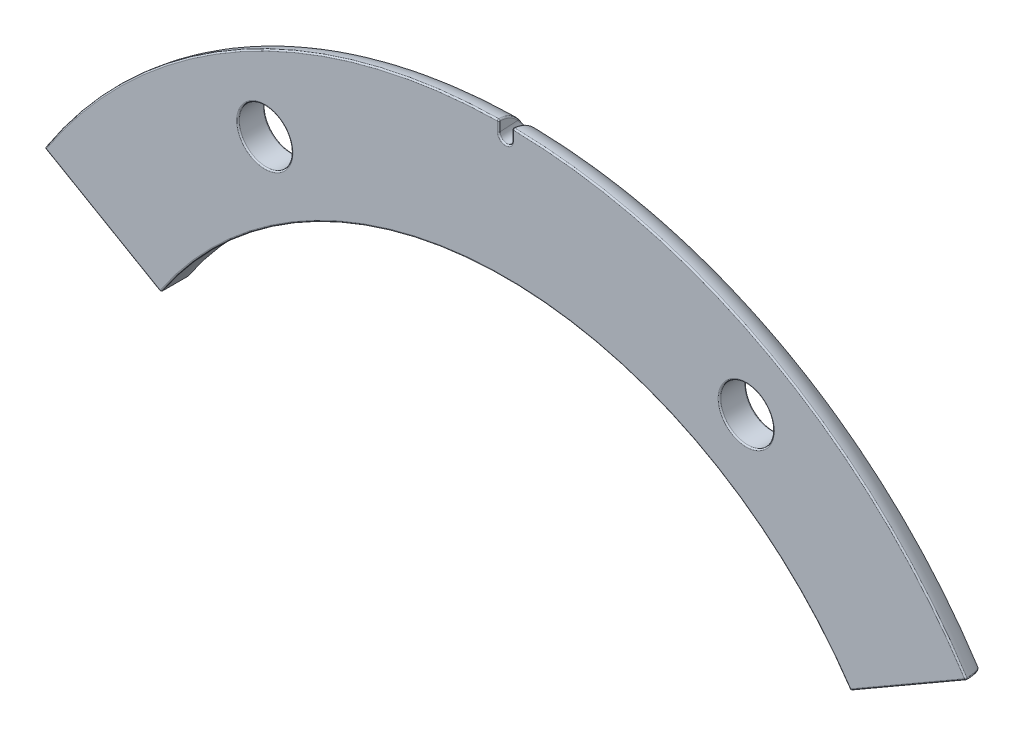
ISO-10303-21;
HEADER;
FILE_DESCRIPTION(('STEP AP214'),'2;1');
FILE_NAME('part.step','',(''),(''),'','','');
FILE_SCHEMA(('AUTOMOTIVE_DESIGN { 1 0 10303 214 1 1 1 1 }'));
ENDSEC;
DATA;
#1=APPLICATION_CONTEXT('core data for automotive mechanical design processes');
#2=APPLICATION_PROTOCOL_DEFINITION('international standard','automotive_design',2000,#1);
#3=PRODUCT_CONTEXT('',#1,'mechanical');
#4=PRODUCT('Part','Part','',(#3));
#5=PRODUCT_RELATED_PRODUCT_CATEGORY('part','',(#4));
#6=PRODUCT_DEFINITION_FORMATION('','',#4);
#7=PRODUCT_DEFINITION_CONTEXT('part definition',#1,'design');
#8=PRODUCT_DEFINITION('design','',#6,#7);
#9=PRODUCT_DEFINITION_SHAPE('','',#8);
#10=(LENGTH_UNIT() NAMED_UNIT(*) SI_UNIT(.MILLI.,.METRE.));
#11=(NAMED_UNIT(*) PLANE_ANGLE_UNIT() SI_UNIT($,.RADIAN.));
#12=(NAMED_UNIT(*) SI_UNIT($,.STERADIAN.) SOLID_ANGLE_UNIT());
#13=UNCERTAINTY_MEASURE_WITH_UNIT(LENGTH_MEASURE(1.E-05),#10,'distance_accuracy_value','');
#14=(GEOMETRIC_REPRESENTATION_CONTEXT(3) GLOBAL_UNCERTAINTY_ASSIGNED_CONTEXT((#13)) GLOBAL_UNIT_ASSIGNED_CONTEXT((#10,
#11,#12)) REPRESENTATION_CONTEXT('',''));
#15=CARTESIAN_POINT('',(0.,0.,0.));
#16=DIRECTION('',(0.,0.,1.));
#17=DIRECTION('',(1.,0.,0.));
#18=AXIS2_PLACEMENT_3D('',#15,#16,#17);
#19=CARTESIAN_POINT('',(0.,0.,5.));
#20=DIRECTION('',(0.,0.,1.));
#21=DIRECTION('',(1.,0.,0.));
#22=AXIS2_PLACEMENT_3D('',#19,#20,#21);
#23=PLANE('',#22);
#24=CARTESIAN_POINT('',(-90.0000000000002,155.884572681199,5.));
#25=DIRECTION('',(0.,0.,1.));
#26=DIRECTION('',(1.,0.,0.));
#27=AXIS2_PLACEMENT_3D('',#24,#25,#26);
#28=CIRCLE('',#27,10.5);
#29=CARTESIAN_POINT('',(-79.5000000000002,155.884572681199,5.));
#30=VERTEX_POINT('',#29);
#31=EDGE_CURVE('E591',#30,#30,#28,.F.);
#32=ORIENTED_EDGE('',*,*,#31,.T.);
#33=EDGE_LOOP('',(#32));
#34=FACE_BOUND('',#33,.T.);
#35=CARTESIAN_POINT('',(90.0000000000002,155.884572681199,5.));
#36=DIRECTION('',(0.,0.,1.));
#37=DIRECTION('',(1.,0.,0.));
#38=AXIS2_PLACEMENT_3D('',#35,#36,#37);
#39=CIRCLE('',#38,10.5);
#40=CARTESIAN_POINT('',(100.5,155.884572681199,5.));
#41=VERTEX_POINT('',#40);
#42=EDGE_CURVE('E543',#41,#41,#39,.F.);
#43=ORIENTED_EDGE('',*,*,#42,.T.);
#44=EDGE_LOOP('',(#43));
#45=FACE_BOUND('',#44,.T.);
#46=CARTESIAN_POINT('',(0.,201.,5.));
#47=DIRECTION('',(0.,0.,1.));
#48=DIRECTION('',(1.,0.,0.));
#49=AXIS2_PLACEMENT_3D('',#46,#47,#48);
#50=CIRCLE('',#49,3.02562460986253);
#51=CARTESIAN_POINT('',(3.02562460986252,201.,5.));
#52=VERTEX_POINT('',#51);
#53=CARTESIAN_POINT('',(-3.02562460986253,201.,5.));
#54=VERTEX_POINT('',#53);
#55=EDGE_CURVE('E420',#52,#54,#50,.F.);
#56=ORIENTED_EDGE('',*,*,#55,.T.);
#57=DIRECTION('',(0.,1.,0.));
#58=VECTOR('',#57,1.);
#59=CARTESIAN_POINT('',(-3.02562460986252,0.,5.));
#60=LINE('',#59,#58);
#61=CARTESIAN_POINT('',(-3.02562460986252,204.464447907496,5.));
#62=VERTEX_POINT('',#61);
#63=EDGE_CURVE('E365',#54,#62,#60,.T.);
#64=ORIENTED_EDGE('',*,*,#63,.T.);
#65=CARTESIAN_POINT('',(0.,0.,5.));
#66=DIRECTION('',(0.,0.,1.));
#67=DIRECTION('',(1.,0.,0.));
#68=AXIS2_PLACEMENT_3D('',#65,#66,#67);
#69=CIRCLE('',#68,204.486832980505);
#70=CARTESIAN_POINT('',(-171.607177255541,111.20180563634,5.));
#71=VERTEX_POINT('',#70);
#72=EDGE_CURVE('E408',#62,#71,#69,.T.);
#73=ORIENTED_EDGE('',*,*,#72,.T.);
#74=DIRECTION('',(0.86602540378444,-0.499999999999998,0.));
#75=VECTOR('',#74,1.);
#76=CARTESIAN_POINT('',(-128.704283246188,86.4318082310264,5.));
#77=LINE('',#76,#75);
#78=CARTESIAN_POINT('',(-129.109592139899,86.6658134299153,5.));
#79=VERTEX_POINT('',#78);
#80=EDGE_CURVE('E407',#71,#79,#77,.T.);
#81=ORIENTED_EDGE('',*,*,#80,.T.);
#82=CARTESIAN_POINT('',(0.,0.,5.));
#83=DIRECTION('',(0.,0.,1.));
#84=DIRECTION('',(1.,0.,0.));
#85=AXIS2_PLACEMENT_3D('',#82,#83,#84);
#86=CIRCLE('',#85,155.5);
#87=CARTESIAN_POINT('',(129.109592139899,86.6658134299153,5.));
#88=VERTEX_POINT('',#87);
#89=EDGE_CURVE('E541',#79,#88,#86,.F.);
#90=ORIENTED_EDGE('',*,*,#89,.T.);
#91=DIRECTION('',(0.86602540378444,0.499999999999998,0.));
#92=VECTOR('',#91,1.);
#93=CARTESIAN_POINT('',(172.073856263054,111.471242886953,5.));
#94=LINE('',#93,#92);
#95=CARTESIAN_POINT('',(171.607177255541,111.20180563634,5.));
#96=VERTEX_POINT('',#95);
#97=EDGE_CURVE('E405',#88,#96,#94,.T.);
#98=ORIENTED_EDGE('',*,*,#97,.T.);
#99=CARTESIAN_POINT('',(3.02562460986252,204.464447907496,5.));
#100=VERTEX_POINT('',#99);
#101=EDGE_CURVE('E395',#96,#100,#69,.T.);
#102=ORIENTED_EDGE('',*,*,#101,.T.);
#103=DIRECTION('',(0.,-1.,0.));
#104=VECTOR('',#103,1.);
#105=CARTESIAN_POINT('',(3.02562460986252,0.,5.));
#106=LINE('',#105,#104);
#107=EDGE_CURVE('E402',#100,#52,#106,.T.);
#108=ORIENTED_EDGE('',*,*,#107,.T.);
#109=EDGE_LOOP('',(#56,#64,#73,#81,#90,#98,#102,#108));
#110=FACE_BOUND('',#109,.T.);
#111=ADVANCED_FACE('F32',(#34,#45,#110),#23,.T.);
#112=CARTESIAN_POINT('',(0.,0.,5.));
#113=DIRECTION('',(0.,0.,1.));
#114=DIRECTION('',(1.,0.,0.));
#115=AXIS2_PLACEMENT_3D('',#112,#113,#114);
#116=TOROIDAL_SURFACE('',#115,195.,10.);
#117=CARTESIAN_POINT('',(-2.63757812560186,201.976761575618,-1.25257876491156));
#118=CARTESIAN_POINT('',(-2.49730981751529,202.41876318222,-1.69175197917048));
#119=CARTESIAN_POINT('',(-3.11167494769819,202.527720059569,-1.55537890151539));
#120=CARTESIAN_POINT('',(-2.66949616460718,201.904596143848,-1.35016898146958));
#121=CARTESIAN_POINT('',(-2.54560395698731,202.337914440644,-1.78049295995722));
#122=CARTESIAN_POINT('',(-3.148450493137,202.437981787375,-1.65810544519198));
#123=CARTESIAN_POINT('',(-2.69869360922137,201.830156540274,-1.44675768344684));
#124=CARTESIAN_POINT('',(-2.59104338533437,202.253138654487,-1.87040233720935));
#125=CARTESIAN_POINT('',(-3.18199430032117,202.345498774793,-1.75977776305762));
#126=CARTESIAN_POINT('',(-2.75100187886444,201.676817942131,-1.63755238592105));
#127=CARTESIAN_POINT('',(-2.67355322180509,202.078575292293,-2.04874245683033));
#128=CARTESIAN_POINT('',(-3.24188070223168,202.15515679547,-1.96061429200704));
#129=CARTESIAN_POINT('',(-2.77410597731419,201.597914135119,-1.73175565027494));
#130=CARTESIAN_POINT('',(-2.71091143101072,201.988768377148,-2.13736420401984));
#131=CARTESIAN_POINT('',(-3.26821533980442,202.057292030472,-2.05977562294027));
#132=CARTESIAN_POINT('',(-2.81376956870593,201.434823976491,-1.91840944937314));
#133=CARTESIAN_POINT('',(-2.7770516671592,201.803305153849,-2.31351983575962));
#134=CARTESIAN_POINT('',(-3.31315668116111,201.855170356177,-2.25625330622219));
#135=CARTESIAN_POINT('',(-2.830238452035,201.350581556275,-2.01082031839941));
#136=CARTESIAN_POINT('',(-2.80600992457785,201.707509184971,-2.40126514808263));
#137=CARTESIAN_POINT('',(-3.33165655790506,201.750846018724,-2.35352790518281));
#138=CARTESIAN_POINT('',(-2.85537103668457,201.178138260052,-2.19198157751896));
#139=CARTESIAN_POINT('',(-2.85393081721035,201.511669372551,-2.57373308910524));
#140=CARTESIAN_POINT('',(-3.35948278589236,201.537449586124,-2.54422396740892));
#141=CARTESIAN_POINT('',(-2.86403707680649,201.089938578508,-2.28073305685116));
#142=CARTESIAN_POINT('',(-2.87316149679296,201.411539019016,-2.65868321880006));
#143=CARTESIAN_POINT('',(-3.36881188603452,201.428378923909,-2.6376465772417));
#144=CARTESIAN_POINT('',(-2.87272192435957,200.909578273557,-2.45444701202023));
#145=CARTESIAN_POINT('',(-2.90089578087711,201.207147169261,-2.82530080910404));
#146=CARTESIAN_POINT('',(-3.3773293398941,201.20548348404,-2.82050337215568));
#147=CARTESIAN_POINT('',(-2.87269402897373,200.817398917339,-2.53938657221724));
#148=CARTESIAN_POINT('',(-2.90958428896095,201.102723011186,-2.90719680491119));
#149=CARTESIAN_POINT('',(-3.3764629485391,201.091636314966,-2.90991343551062));
#150=CARTESIAN_POINT('',(-2.8629578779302,200.630293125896,-2.70426292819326));
#151=CARTESIAN_POINT('',(-2.9151804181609,200.891221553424,-3.06644777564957));
#152=CARTESIAN_POINT('',(-3.36340946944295,200.860681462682,-3.08346749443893));
#153=CARTESIAN_POINT('',(-2.85325208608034,200.535367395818,-2.78420099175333));
#154=CARTESIAN_POINT('',(-2.91229869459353,200.783969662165,-3.14404788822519));
#155=CARTESIAN_POINT('',(-3.35122526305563,200.7435746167,-3.16761282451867));
#156=CARTESIAN_POINT('',(-2.82335567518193,200.344284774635,-2.93797417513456));
#157=CARTESIAN_POINT('',(-2.89398762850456,200.568616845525,-3.29356627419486));
#158=CARTESIAN_POINT('',(-3.31462421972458,200.507958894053,-3.32947933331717));
#159=CARTESIAN_POINT('',(-2.80322358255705,200.248137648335,-3.0118407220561));
#160=CARTESIAN_POINT('',(-2.87879110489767,200.46032088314,-3.36574533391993));
#161=CARTESIAN_POINT('',(-3.29027569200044,200.389461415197,-3.40723359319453));
#162=CARTESIAN_POINT('',(-2.75177984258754,200.05546617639,-3.15325393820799));
#163=CARTESIAN_POINT('',(-2.8353142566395,200.243929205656,-3.50414423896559));
#164=CARTESIAN_POINT('',(-3.22855274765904,200.152100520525,-3.5560896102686));
#165=CARTESIAN_POINT('',(-2.72047368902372,199.958942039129,-3.22080369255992));
#166=CARTESIAN_POINT('',(-2.80715120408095,200.135592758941,-3.57059164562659));
#167=CARTESIAN_POINT('',(-3.19118473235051,200.03323731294,-3.62719461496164));
#168=CARTESIAN_POINT('',(-2.63096837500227,199.727983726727,-3.37512790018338));
#169=CARTESIAN_POINT('',(-2.72323707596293,199.877705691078,-3.72234599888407));
#170=CARTESIAN_POINT('',(-3.08477392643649,199.748924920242,-3.78964114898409));
#171=CARTESIAN_POINT('',(-2.56701126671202,199.594062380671,-3.45857853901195));
#172=CARTESIAN_POINT('',(-2.66081630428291,199.727942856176,-3.80526693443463));
#173=CARTESIAN_POINT('',(-3.00903098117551,199.584146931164,-3.87748392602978));
#174=CARTESIAN_POINT('',(-2.41533945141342,199.333591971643,-3.61084779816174));
#175=CARTESIAN_POINT('',(-2.50925568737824,199.43828525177,-3.95686376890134));
#176=CARTESIAN_POINT('',(-2.82994364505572,199.263771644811,-4.03776735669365));
#177=CARTESIAN_POINT('',(-2.32761655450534,199.207045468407,-3.67966135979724));
#178=CARTESIAN_POINT('',(-2.42004184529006,199.297702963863,-4.02598087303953));
#179=CARTESIAN_POINT('',(-2.72658973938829,199.108177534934,-4.11020268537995));
#180=CARTESIAN_POINT('',(-2.12931820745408,198.966602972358,-3.80264990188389));
#181=CARTESIAN_POINT('',(-2.21660922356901,199.03209514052,-4.14988285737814));
#182=CARTESIAN_POINT('',(-2.49335705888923,198.81260857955,-4.23966430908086));
#183=CARTESIAN_POINT('',(-2.01868593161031,198.85273954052,-3.85678769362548));
#184=CARTESIAN_POINT('',(-2.10210351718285,198.906552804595,-4.204929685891));
#185=CARTESIAN_POINT('',(-2.36341233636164,198.672673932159,-4.29665145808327));
#186=CARTESIAN_POINT('',(-1.77746960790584,198.64327571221,-3.95098027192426));
#187=CARTESIAN_POINT('',(-1.85181698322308,198.676788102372,-4.30110854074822));
#188=CARTESIAN_POINT('',(-2.08038492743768,198.415281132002,-4.39580154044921));
#189=CARTESIAN_POINT('',(-1.64688778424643,198.547673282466,-3.99103662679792));
#190=CARTESIAN_POINT('',(-1.71576593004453,198.572215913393,-4.34239943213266));
#191=CARTESIAN_POINT('',(-1.92730482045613,198.297820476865,-4.43796612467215));
#192=CARTESIAN_POINT('',(-1.37668211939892,198.383170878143,-4.05683939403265));
#193=CARTESIAN_POINT('',(-1.43425626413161,198.393003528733,-4.41057232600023));
#194=CARTESIAN_POINT('',(-1.61074781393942,198.095718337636,-4.50723219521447));
#195=CARTESIAN_POINT('',(-1.23783250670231,198.313178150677,-4.08319914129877));
#196=CARTESIAN_POINT('',(-1.28942326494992,198.317005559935,-4.43811859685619));
#197=CARTESIAN_POINT('',(-1.44816842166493,198.009733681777,-4.53497929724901));
#198=CARTESIAN_POINT('',(-0.949719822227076,198.196093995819,-4.12589958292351));
#199=CARTESIAN_POINT('',(-0.989095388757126,198.190187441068,-4.48294685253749));
#200=CARTESIAN_POINT('',(-1.11093961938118,197.865901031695,-4.57992713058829));
#201=CARTESIAN_POINT('',(-0.80045699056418,198.149002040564,-4.14224050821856));
#202=CARTESIAN_POINT('',(-0.833529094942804,198.139352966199,-4.50023317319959));
#203=CARTESIAN_POINT('',(-0.936290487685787,197.808052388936,-4.59712810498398));
#204=CARTESIAN_POINT('',(-0.495925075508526,198.079386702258,-4.16600596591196));
#205=CARTESIAN_POINT('',(-0.516284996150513,198.064270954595,-4.52544930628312));
#206=CARTESIAN_POINT('',(-0.580032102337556,197.722535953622,-4.62214437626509));
#207=CARTESIAN_POINT('',(-0.340660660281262,198.0568446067,-4.17343728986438));
#208=CARTESIAN_POINT('',(-0.354646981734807,198.04002971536,-4.53337705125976));
#209=CARTESIAN_POINT('',(-0.39842825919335,197.694845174,-4.62996682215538));
#210=CARTESIAN_POINT('',(-0.028391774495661,198.037003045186,-4.1799914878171));
#211=CARTESIAN_POINT('',(-0.029529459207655,198.01867670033,-4.54037079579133));
#212=CARTESIAN_POINT('',(-0.0332037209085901,197.670471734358,-4.6368659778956));
#213=CARTESIAN_POINT('',(0.128612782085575,198.039704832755,-4.1791139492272));
#214=CARTESIAN_POINT('',(0.133853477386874,198.021578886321,-4.53943222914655));
#215=CARTESIAN_POINT('',(0.150417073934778,197.673790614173,-4.63594225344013));
#216=CARTESIAN_POINT('',(0.441194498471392,198.070390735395,-4.16893723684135));
#217=CARTESIAN_POINT('',(0.459321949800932,198.054611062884,-4.52858059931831));
#218=CARTESIAN_POINT('',(0.516017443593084,197.711485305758,-4.62522992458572));
#219=CARTESIAN_POINT('',(0.596750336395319,198.098576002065,-4.15957105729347));
#220=CARTESIAN_POINT('',(0.621296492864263,198.084938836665,-4.51860233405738));
#221=CARTESIAN_POINT('',(0.697972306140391,197.746108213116,-4.61537078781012));
#222=CARTESIAN_POINT('',(0.900666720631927,198.179558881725,-4.131592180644));
#223=CARTESIAN_POINT('',(0.93795260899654,198.172349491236,-4.48897479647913));
#224=CARTESIAN_POINT('',(1.05354240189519,197.845589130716,-4.5859193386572));
#225=CARTESIAN_POINT('',(1.0490275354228,198.232355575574,-4.11297982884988));
#226=CARTESIAN_POINT('',(1.09261996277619,198.229407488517,-4.46933439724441));
#227=CARTESIAN_POINT('',(1.22715794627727,197.910446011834,-4.5663273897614));
#228=CARTESIAN_POINT('',(1.3337400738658,198.360452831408,-4.06536351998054));
#229=CARTESIAN_POINT('',(1.38941454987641,198.368323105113,-4.41948890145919));
#230=CARTESIAN_POINT('',(1.56046369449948,198.06781000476,-4.51620495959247));
#231=CARTESIAN_POINT('',(1.47013085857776,198.435676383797,-4.0363950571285));
#232=CARTESIAN_POINT('',(1.531681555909,198.450128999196,-4.38930872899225));
#233=CARTESIAN_POINT('',(1.72019917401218,198.160222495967,-4.48571184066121));
#234=CARTESIAN_POINT('',(1.7274947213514,198.605795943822,-3.96666596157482));
#235=CARTESIAN_POINT('',(1.7996768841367,198.63572931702,-4.31730202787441));
#236=CARTESIAN_POINT('',(2.02179567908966,198.369232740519,-4.41231279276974));
#237=CARTESIAN_POINT('',(1.84847077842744,198.700688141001,-3.92590761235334));
#238=CARTESIAN_POINT('',(1.92560786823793,198.739680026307,-4.27541338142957));
#239=CARTESIAN_POINT('',(2.16366015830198,198.485825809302,-4.36940926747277));
#240=CARTESIAN_POINT('',(2.07083854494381,198.905427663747,-3.83181378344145));
#241=CARTESIAN_POINT('',(2.15603574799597,198.964536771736,-4.17957128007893));
#242=CARTESIAN_POINT('',(2.42466190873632,198.737426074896,-4.27036313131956));
#243=CARTESIAN_POINT('',(2.1723840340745,199.015144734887,-3.77858517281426));
#244=CARTESIAN_POINT('',(2.26093556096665,199.085624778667,-4.12556724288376));
#245=CARTESIAN_POINT('',(2.5439775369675,198.872272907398,-4.21433301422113));
#246=CARTESIAN_POINT('',(2.35499052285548,199.24564016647,-3.65880228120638));
#247=CARTESIAN_POINT('',(2.44787221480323,199.340456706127,-4.00507540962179));
#248=CARTESIAN_POINT('',(2.75883356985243,199.155630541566,-4.08824575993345));
#249=CARTESIAN_POINT('',(2.4360489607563,199.366419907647,-3.59224633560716));
#250=CARTESIAN_POINT('',(2.53008329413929,199.47468979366,-3.93831899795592));
#251=CARTESIAN_POINT('',(2.85437100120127,199.304143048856,-4.01818687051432));
#252=CARTESIAN_POINT('',(2.57844168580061,199.617158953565,-3.44433186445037));
#253=CARTESIAN_POINT('',(2.67200866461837,199.753680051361,-3.79114990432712));
#254=CARTESIAN_POINT('',(3.02255981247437,199.612563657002,-3.86248742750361));
#255=CARTESIAN_POINT('',(2.63927784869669,199.747265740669,-3.36266729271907));
#256=CARTESIAN_POINT('',(2.73119012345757,199.89920538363,-3.71006323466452));
#257=CARTESIAN_POINT('',(3.09463242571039,199.772655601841,-3.77652472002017));
#258=CARTESIAN_POINT('',(2.73906846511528,200.009356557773,-3.18664002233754));
#259=CARTESIAN_POINT('',(2.82457422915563,200.192499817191,-3.53668293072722));
#260=CARTESIAN_POINT('',(3.21331467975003,200.095304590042,-3.591232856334));
#261=CARTESIAN_POINT('',(2.77802683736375,200.14134024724,-3.09227960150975));
#262=CARTESIAN_POINT('',(2.85863392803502,200.340921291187,-3.44386879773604));
#263=CARTESIAN_POINT('',(3.25992888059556,200.257861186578,-3.491906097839));
#264=CARTESIAN_POINT('',(2.83420516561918,200.396851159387,-2.89735812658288));
#265=CARTESIAN_POINT('',(2.90222921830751,200.628194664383,-3.25370714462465));
#266=CARTESIAN_POINT('',(3.32775175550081,200.57274978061,-3.28672559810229));
#267=CARTESIAN_POINT('',(2.85240647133,200.520473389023,-2.79733586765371));
#268=CARTESIAN_POINT('',(2.912617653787,200.767791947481,-3.15621466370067));
#269=CARTESIAN_POINT('',(3.35010466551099,200.725189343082,-3.18143900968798));
#270=CARTESIAN_POINT('',(2.87230851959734,200.763720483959,-2.58852131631));
#271=CARTESIAN_POINT('',(2.91414697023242,201.042538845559,-2.95412308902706));
#272=CARTESIAN_POINT('',(3.37552696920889,201.025346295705,-2.96163421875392));
#273=CARTESIAN_POINT('',(2.87398454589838,200.883339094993,-2.47971613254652));
#274=CARTESIAN_POINT('',(2.90483700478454,201.178080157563,-2.84899129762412));
#275=CARTESIAN_POINT('',(3.37856747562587,201.17305628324,-2.84710244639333));
#276=CARTESIAN_POINT('',(2.86405821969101,201.089513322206,-2.28114504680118));
#277=CARTESIAN_POINT('',(2.87323011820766,201.411050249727,-2.65908523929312));
#278=CARTESIAN_POINT('',(3.36883273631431,201.427853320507,-2.63808025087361));
#279=CARTESIAN_POINT('',(2.8554550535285,201.177285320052,-2.19284058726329));
#280=CARTESIAN_POINT('',(2.85411934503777,201.510691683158,-2.57456368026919));
#281=CARTESIAN_POINT('',(3.3595732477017,201.536394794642,-2.54512818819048));
#282=CARTESIAN_POINT('',(2.83051511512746,201.348955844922,-2.01256475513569));
#283=CARTESIAN_POINT('',(2.80651578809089,201.705650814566,-2.40293241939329));
#284=CARTESIAN_POINT('',(3.33196539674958,201.748833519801,-2.35536415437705));
#285=CARTESIAN_POINT('',(2.81417316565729,201.432851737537,-1.92059096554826));
#286=CARTESIAN_POINT('',(2.77775539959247,201.801052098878,-2.31559769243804));
#287=CARTESIAN_POINT('',(3.31361094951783,201.852727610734,-2.25854963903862));
#288=CARTESIAN_POINT('',(2.77463240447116,201.59605269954,-1.73395930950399));
#289=CARTESIAN_POINT('',(2.7117618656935,201.986661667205,-2.13942684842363));
#290=CARTESIAN_POINT('',(3.26881475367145,202.054983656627,-2.06209526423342));
#291=CARTESIAN_POINT('',(2.75145954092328,201.675373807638,-1.63931280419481));
#292=CARTESIAN_POINT('',(2.67427735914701,202.076943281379,-2.05038074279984));
#293=CARTESIAN_POINT('',(3.24240359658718,202.153364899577,-1.96246736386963));
#294=CARTESIAN_POINT('',(2.69895956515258,201.829477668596,-1.44763840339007));
#295=CARTESIAN_POINT('',(2.59145131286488,202.25237689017,-1.87121017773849));
#296=CARTESIAN_POINT('',(3.18229984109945,202.344655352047,-1.76070483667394));
#297=CARTESIAN_POINT('',(2.669641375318,201.904266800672,-1.35061413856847));
#298=CARTESIAN_POINT('',(2.54582034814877,202.337551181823,-1.78089153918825));
#299=CARTESIAN_POINT('',(3.14861779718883,202.437572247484,-1.65857403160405));
#300=CARTESIAN_POINT('',(2.63757812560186,201.976761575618,-1.25257876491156));
#301=CARTESIAN_POINT('',(2.49730981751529,202.41876318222,-1.69175197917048));
#302=CARTESIAN_POINT('',(3.11167494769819,202.527720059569,-1.55537890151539));
#303=(BOUNDED_SURFACE() B_SPLINE_SURFACE(3,2,((#117,#118,#119),(#120,#121,#122),(#123,#124,
#125),(#126,#127,#128),(#129,#130,#131),(#132,#133,#134),(#135,#136,#137),(#138,#139,#140),
(#141,#142,#143),(#144,#145,#146),(#147,#148,#149),(#150,#151,#152),(#153,#154,#155),(#156,#157,
#158),(#159,#160,#161),(#162,#163,#164),(#165,#166,#167),(#168,#169,#170),(#171,#172,#173),
(#174,#175,#176),(#177,#178,#179),(#180,#181,#182),(#183,#184,#185),(#186,#187,#188),(#189,#190,
#191),(#192,#193,#194),(#195,#196,#197),(#198,#199,#200),(#201,#202,#203),(#204,#205,#206),
(#207,#208,#209),(#210,#211,#212),(#213,#214,#215),(#216,#217,#218),(#219,#220,#221),(#222,#223,
#224),(#225,#226,#227),(#228,#229,#230),(#231,#232,#233),(#234,#235,#236),(#237,#238,#239),
(#240,#241,#242),(#243,#244,#245),(#246,#247,#248),(#249,#250,#251),(#252,#253,#254),(#255,#256,
#257),(#258,#259,#260),(#261,#262,#263),(#264,#265,#266),(#267,#268,#269),(#270,#271,#272),
(#273,#274,#275),(#276,#277,#278),(#279,#280,#281),(#282,#283,#284),(#285,#286,#287),(#288,#289,
#290),(#291,#292,#293),(#294,#295,#296),(#297,#298,#299),(#300,#301,#302)),.UNSPECIFIED.,.F.,
.F.,.F.) B_SPLINE_SURFACE_WITH_KNOTS((4,2,2,2,2,2,2,2,2,2,2,2,2,2,2,2,2,2,2,2,2,2,2,2,2,2,2,2,2,
2,4),(3,3),(0.,0.404150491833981,0.808745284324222,1.21869176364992,1.62851532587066,
2.04054045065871,2.45246070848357,2.86209338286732,3.27152493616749,3.84712144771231,
4.42291656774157,5.00015740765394,5.57733393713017,6.12576477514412,6.67418297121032,
7.22218285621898,7.77020995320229,8.32260098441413,8.87497138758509,9.42546648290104,
9.97585502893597,10.5216890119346,11.0675912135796,11.6260861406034,12.1844809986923,
12.7152117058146,13.2467360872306,13.6545720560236,14.0626812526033,14.4692597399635,
14.8752519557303),(0.,1.),
.UNSPECIFIED.) GEOMETRIC_REPRESENTATION_ITEM() RATIONAL_B_SPLINE_SURFACE(((1.,0.616432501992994,
1.),(1.,0.625879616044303,1.),(1.,0.635076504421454,1.),(1.,0.652934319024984,1.),(1.,
0.661594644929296,1.),(1.,0.678433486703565,1.),(1.,0.686604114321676,1.),(1.,0.70227992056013,
1.),(1.,0.709785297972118,1.),(1.,0.724114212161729,1.),(1.,0.730933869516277,1.),(1.,
0.743785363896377,1.),(1.,0.749817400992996,1.),(1.,0.761013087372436,1.),(1.,0.766181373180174,
1.),(1.,0.775651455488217,1.),(1.,0.779953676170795,1.),(1.,0.789252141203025,1.),(1.,
0.793821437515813,1.),(1.,0.801301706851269,1.),(1.,0.804212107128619,1.),(1.,0.808617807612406,
1.),(1.,0.810109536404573,1.),(1.,0.812043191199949,1.),(1.,0.812485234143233,1.),(1.,
0.812761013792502,1.),(1.,0.812623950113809,1.),(1.,0.81217214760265,1.),(1.,0.811857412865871,
1.),(1.,0.811328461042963,1.),(1.,0.811114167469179,1.),(1.,0.810927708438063,1.),(1.,
0.810955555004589,1.),(1.,0.811237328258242,1.),(1.,0.811493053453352,1.),(1.,0.812054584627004,
1.),(1.,0.812360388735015,1.),(1.,0.812712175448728,1.),(1.,0.812759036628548,1.),(1.,
0.81221503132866,1.),(1.,0.811624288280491,1.),(1.,0.809431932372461,1.),(1.,0.807838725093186,
1.),(1.,0.803343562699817,1.),(1.,0.800441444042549,1.),(1.,0.793053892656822,1.),(1.,
0.788533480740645,1.),(1.,0.777859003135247,1.),(1.,0.771705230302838,1.),(1.,0.758158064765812,
1.),(1.,0.750841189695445,1.),(1.,0.734862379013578,1.),(1.,0.726198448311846,1.),(1.,
0.709819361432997,1.),(1.,0.702352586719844,1.),(1.,0.686756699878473,1.),(1.,0.678627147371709,
1.),(1.,0.661796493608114,1.),(1.,0.653097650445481,1.),(1.,0.635160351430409,1.),(1.,
0.625922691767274,1.),(1.,0.616432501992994,1.))) REPRESENTATION_ITEM('') SURFACE());
#304=CARTESIAN_POINT('',(-3.11167494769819,202.527720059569,-1.55537890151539));
#305=CARTESIAN_POINT('',(-3.148450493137,202.437981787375,-1.65810544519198));
#306=CARTESIAN_POINT('',(-3.18199430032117,202.345498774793,-1.75977776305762));
#307=CARTESIAN_POINT('',(-3.24188070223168,202.15515679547,-1.96061429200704));
#308=CARTESIAN_POINT('',(-3.26821533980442,202.057292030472,-2.05977562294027));
#309=CARTESIAN_POINT('',(-3.31315668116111,201.855170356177,-2.25625330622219));
#310=CARTESIAN_POINT('',(-3.33165655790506,201.750846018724,-2.35352790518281));
#311=CARTESIAN_POINT('',(-3.35948278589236,201.537449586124,-2.54422396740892));
#312=CARTESIAN_POINT('',(-3.36881188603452,201.428378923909,-2.6376465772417));
#313=CARTESIAN_POINT('',(-3.3773293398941,201.20548348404,-2.82050337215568));
#314=CARTESIAN_POINT('',(-3.3764629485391,201.091636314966,-2.90991343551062));
#315=CARTESIAN_POINT('',(-3.36340946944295,200.860681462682,-3.08346749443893));
#316=CARTESIAN_POINT('',(-3.35122526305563,200.7435746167,-3.16761282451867));
#317=CARTESIAN_POINT('',(-3.31462421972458,200.507958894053,-3.32947933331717));
#318=CARTESIAN_POINT('',(-3.29027569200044,200.389461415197,-3.40723359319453));
#319=CARTESIAN_POINT('',(-3.22855274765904,200.152100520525,-3.5560896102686));
#320=CARTESIAN_POINT('',(-3.19118473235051,200.03323731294,-3.62719461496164));
#321=CARTESIAN_POINT('',(-3.08477392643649,199.748924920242,-3.78964114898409));
#322=CARTESIAN_POINT('',(-3.00903098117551,199.584146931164,-3.87748392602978));
#323=CARTESIAN_POINT('',(-2.82994364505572,199.263771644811,-4.03776735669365));
#324=CARTESIAN_POINT('',(-2.72658973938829,199.108177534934,-4.11020268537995));
#325=CARTESIAN_POINT('',(-2.49335705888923,198.81260857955,-4.23966430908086));
#326=CARTESIAN_POINT('',(-2.36341233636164,198.672673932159,-4.29665145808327));
#327=CARTESIAN_POINT('',(-2.08038492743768,198.415281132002,-4.39580154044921));
#328=CARTESIAN_POINT('',(-1.92730482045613,198.297820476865,-4.43796612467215));
#329=CARTESIAN_POINT('',(-1.61074781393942,198.095718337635,-4.50723219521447));
#330=CARTESIAN_POINT('',(-1.44816842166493,198.009733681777,-4.53497929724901));
#331=CARTESIAN_POINT('',(-1.11093961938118,197.865901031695,-4.57992713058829));
#332=CARTESIAN_POINT('',(-0.936290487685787,197.808052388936,-4.59712810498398));
#333=CARTESIAN_POINT('',(-0.580032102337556,197.722535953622,-4.62214437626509));
#334=CARTESIAN_POINT('',(-0.39842825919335,197.694845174,-4.62996682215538));
#335=CARTESIAN_POINT('',(-0.03320372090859,197.670471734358,-4.6368659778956));
#336=CARTESIAN_POINT('',(0.150417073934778,197.673790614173,-4.63594225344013));
#337=CARTESIAN_POINT('',(0.516017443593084,197.711485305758,-4.62522992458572));
#338=CARTESIAN_POINT('',(0.697972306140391,197.746108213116,-4.61537078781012));
#339=CARTESIAN_POINT('',(1.05354240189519,197.845589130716,-4.5859193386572));
#340=CARTESIAN_POINT('',(1.22715794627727,197.910446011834,-4.5663273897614));
#341=CARTESIAN_POINT('',(1.56046369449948,198.06781000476,-4.51620495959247));
#342=CARTESIAN_POINT('',(1.72019917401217,198.160222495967,-4.48571184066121));
#343=CARTESIAN_POINT('',(2.02179567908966,198.369232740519,-4.41231279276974));
#344=CARTESIAN_POINT('',(2.16366015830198,198.485825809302,-4.36940926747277));
#345=CARTESIAN_POINT('',(2.42466190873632,198.737426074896,-4.27036313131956));
#346=CARTESIAN_POINT('',(2.5439775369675,198.872272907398,-4.21433301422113));
#347=CARTESIAN_POINT('',(2.75883356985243,199.155630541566,-4.08824575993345));
#348=CARTESIAN_POINT('',(2.85437100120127,199.304143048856,-4.01818687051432));
#349=CARTESIAN_POINT('',(3.02255981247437,199.612563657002,-3.86248742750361));
#350=CARTESIAN_POINT('',(3.09463242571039,199.772655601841,-3.77652472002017));
#351=CARTESIAN_POINT('',(3.21331467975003,200.095304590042,-3.591232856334));
#352=CARTESIAN_POINT('',(3.25992888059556,200.257861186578,-3.491906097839));
#353=CARTESIAN_POINT('',(3.32775175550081,200.57274978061,-3.28672559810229));
#354=CARTESIAN_POINT('',(3.35010466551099,200.725189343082,-3.18143900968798));
#355=CARTESIAN_POINT('',(3.37552696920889,201.025346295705,-2.96163421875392));
#356=CARTESIAN_POINT('',(3.37856747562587,201.17305628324,-2.84710244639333));
#357=CARTESIAN_POINT('',(3.36883273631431,201.427853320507,-2.63808025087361));
#358=CARTESIAN_POINT('',(3.3595732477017,201.536394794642,-2.54512818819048));
#359=CARTESIAN_POINT('',(3.33196539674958,201.748833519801,-2.35536415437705));
#360=CARTESIAN_POINT('',(3.31361094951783,201.852727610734,-2.25854963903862));
#361=CARTESIAN_POINT('',(3.26881475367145,202.054983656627,-2.06209526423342));
#362=CARTESIAN_POINT('',(3.24240359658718,202.153364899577,-1.96246736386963));
#363=CARTESIAN_POINT('',(3.18229984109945,202.344655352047,-1.76070483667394));
#364=CARTESIAN_POINT('',(3.14861779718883,202.437572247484,-1.65857403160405));
#365=CARTESIAN_POINT('',(3.11167494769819,202.527720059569,-1.55537890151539));
#366=B_SPLINE_CURVE_WITH_KNOTS('',3,(#304,#305,#306,#307,#308,#309,#310,#311,#312,#313,#314,
#315,#316,#317,#318,#319,#320,#321,#322,#323,#324,#325,#326,#327,#328,#329,#330,#331,#332,#333,
#334,#335,#336,#337,#338,#339,#340,#341,#342,#343,#344,#345,#346,#347,#348,#349,#350,#351,#352,
#353,#354,#355,#356,#357,#358,#359,#360,#361,#362,#363,#364,#365),.UNSPECIFIED.,.F.,.F.,(4,2,2,
2,2,2,2,2,2,2,2,2,2,2,2,2,2,2,2,2,2,2,2,2,2,2,2,2,2,2,4),(0.,0.404150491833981,
0.808745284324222,1.21869176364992,1.62851532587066,2.04054045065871,2.45246070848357,
2.86209338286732,3.27152493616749,3.84712144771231,4.42291656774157,5.00015740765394,
5.57733393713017,6.12576477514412,6.67418297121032,7.22218285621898,7.77020995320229,
8.32260098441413,8.87497138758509,9.42546648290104,9.97585502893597,10.5216890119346,
11.0675912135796,11.6260861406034,12.1844809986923,12.7152117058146,13.2467360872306,
13.6545720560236,14.0626812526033,14.4692597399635,14.8752519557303),.UNSPECIFIED.);
#367=CARTESIAN_POINT('',(-3.37305920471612,201.317229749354,-2.72883005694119));
#368=VERTEX_POINT('',#367);
#369=CARTESIAN_POINT('',(3.37305920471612,201.317229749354,-2.72883005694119));
#370=VERTEX_POINT('',#369);
#371=EDGE_CURVE('E41',#368,#370,#366,.T.);
#372=ORIENTED_EDGE('',*,*,#371,.T.);
#373=CARTESIAN_POINT('',(2.94742939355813,198.228719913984,-3.94858787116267));
#374=CARTESIAN_POINT('',(2.9699396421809,198.393457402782,-4.3987928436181));
#375=CARTESIAN_POINT('',(3.44978732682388,198.400203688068,-4.39328322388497));
#376=CARTESIAN_POINT('',(2.94284720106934,198.479870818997,-3.85694402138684));
#377=CARTESIAN_POINT('',(2.96514480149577,198.657567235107,-4.30289602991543));
#378=CARTESIAN_POINT('',(3.44542712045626,198.664565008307,-4.29681601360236));
#379=CARTESIAN_POINT('',(2.93773347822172,198.727118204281,-3.75466956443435));
#380=CARTESIAN_POINT('',(2.95979332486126,198.917498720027,-4.19586649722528));
#381=CARTESIAN_POINT('',(3.44052959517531,198.924817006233,-4.18915869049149));
#382=CARTESIAN_POINT('',(2.92648502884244,199.212101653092,-3.52970057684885));
#383=CARTESIAN_POINT('',(2.94801937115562,199.427447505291,-3.96038742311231));
#384=CARTESIAN_POINT('',(3.42970030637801,199.435308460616,-3.95234922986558));
#385=CARTESIAN_POINT('',(2.92035035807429,199.449838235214,-3.40700716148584));
#386=CARTESIAN_POINT('',(2.94159544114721,199.677475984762,-3.83190882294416));
#387=CARTESIAN_POINT('',(3.42376859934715,199.685548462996,-3.82319826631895));
#388=CARTESIAN_POINT('',(2.90710820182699,199.913890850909,-3.14216403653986));
#389=CARTESIAN_POINT('',(2.92772643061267,200.165614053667,-3.55452861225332));
#390=CARTESIAN_POINT('',(3.41091730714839,200.174006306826,-3.5444160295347));
#391=CARTESIAN_POINT('',(2.90000169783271,200.140218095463,-3.00003395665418));
#392=CARTESIAN_POINT('',(2.92028079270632,200.40374102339,-3.40561585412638));
#393=CARTESIAN_POINT('',(3.40399871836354,200.41223594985,-3.39480541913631));
#394=CARTESIAN_POINT('',(2.88486593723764,200.580048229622,-2.69731874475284));
#395=CARTESIAN_POINT('',(2.90442013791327,200.866609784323,-3.08840275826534));
#396=CARTESIAN_POINT('',(3.38922254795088,200.875195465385,-3.07615782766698));
#397=CARTESIAN_POINT('',(2.87683669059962,200.79355125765,-2.53673381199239));
#398=CARTESIAN_POINT('',(2.89600353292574,201.091351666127,-2.92007065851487));
#399=CARTESIAN_POINT('',(3.38136497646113,201.09992548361,-2.90712105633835));
#400=CARTESIAN_POINT('',(2.85141050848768,201.413378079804,-2.02821016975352));
#401=CARTESIAN_POINT('',(2.86933089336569,201.744362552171,-2.38661786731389));
#402=CARTESIAN_POINT('',(3.35642832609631,201.75234414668,-2.37183301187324));
#403=CARTESIAN_POINT('',(2.83269074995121,201.798473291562,-1.6538149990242));
#404=CARTESIAN_POINT('',(2.84969021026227,202.150038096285,-1.9938042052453));
#405=CARTESIAN_POINT('',(3.33800047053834,202.157686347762,-1.9777328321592));
#406=CARTESIAN_POINT('',(2.79229229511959,202.500124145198,-0.845845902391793));
#407=CARTESIAN_POINT('',(2.80729698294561,202.889751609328,-1.14593965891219));
#408=CARTESIAN_POINT('',(3.29810939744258,202.896223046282,-1.12723904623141));
#409=CARTESIAN_POINT('',(2.77061290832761,202.816663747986,-0.412258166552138));
#410=CARTESIAN_POINT('',(2.78453218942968,203.223648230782,-0.690643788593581));
#411=CARTESIAN_POINT('',(3.27664547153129,203.229400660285,-0.670830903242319));
#412=CARTESIAN_POINT('',(2.72489733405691,203.372579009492,0.502053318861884));
#413=CARTESIAN_POINT('',(2.73651606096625,203.810723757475,0.269678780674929));
#414=CARTESIAN_POINT('',(3.23128209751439,203.814530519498,0.291602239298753));
#415=CARTESIAN_POINT('',(2.70085986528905,203.611912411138,0.982802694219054));
#416=CARTESIAN_POINT('',(2.71125426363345,204.063666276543,0.774914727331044));
#417=CARTESIAN_POINT('',(3.2073813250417,204.066438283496,0.797654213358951));
#418=CARTESIAN_POINT('',(2.65113859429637,204.006086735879,1.97722811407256));
#419=CARTESIAN_POINT('',(2.65898465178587,204.481054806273,1.8203069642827));
#420=CARTESIAN_POINT('',(3.15785518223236,204.481314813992,1.84441781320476));
#421=CARTESIAN_POINT('',(2.62545709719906,204.161043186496,2.49085805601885));
#422=CARTESIAN_POINT('',(2.63197334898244,204.645382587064,2.36053302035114));
#423=CARTESIAN_POINT('',(3.13223222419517,204.644405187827,2.38508090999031));
#424=CARTESIAN_POINT('',(2.58729653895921,204.322762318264,3.25406922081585));
#425=CARTESIAN_POINT('',(2.5918516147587,204.817503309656,3.162967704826));
#426=CARTESIAN_POINT('',(3.09410306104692,204.814604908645,3.18846108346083));
#427=CARTESIAN_POINT('',(2.57516234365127,204.364383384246,3.49675312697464));
#428=CARTESIAN_POINT('',(2.57908174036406,204.861946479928,3.41836519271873));
#429=CARTESIAN_POINT('',(3.08197089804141,204.858406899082,3.44391782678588));
#430=CARTESIAN_POINT('',(2.55077666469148,204.428655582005,3.9844667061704));
#431=CARTESIAN_POINT('',(2.55341347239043,204.930891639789,3.93173055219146));
#432=CARTESIAN_POINT('',(3.05757413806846,204.92604278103,3.95730054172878));
#433=CARTESIAN_POINT('',(2.53852528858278,204.45132268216,4.22949422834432));
#434=CARTESIAN_POINT('',(2.54051519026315,204.955384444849,4.18969619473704));
#435=CARTESIAN_POINT('',(3.04530966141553,204.949893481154,4.21522424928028));
#436=CARTESIAN_POINT('',(2.5129506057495,204.478664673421,4.74098788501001));
#437=CARTESIAN_POINT('',(2.51358335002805,204.985497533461,4.72833299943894));
#438=CARTESIAN_POINT('',(3.01969255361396,204.978655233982,4.75363862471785));
#439=CARTESIAN_POINT('',(2.49962288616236,204.481686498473,5.00754227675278));
#440=CARTESIAN_POINT('',(2.49954637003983,204.989345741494,5.00907259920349));
#441=CARTESIAN_POINT('',(3.00633425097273,204.981826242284,5.03422219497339));
#442=CARTESIAN_POINT('',(2.47299543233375,204.465319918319,5.540091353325));
#443=CARTESIAN_POINT('',(2.47149570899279,204.973449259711,5.57008582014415));
#444=CARTESIAN_POINT('',(2.97962944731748,204.964578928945,5.59480017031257));
#445=CARTESIAN_POINT('',(2.45969571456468,204.445920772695,5.80608570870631));
#446=CARTESIAN_POINT('',(2.45748256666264,204.95366175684,5.85034866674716));
#447=CARTESIAN_POINT('',(2.96628295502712,204.944149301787,5.87479422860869));
#448=CARTESIAN_POINT('',(2.43314582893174,204.384634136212,6.33708342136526));
#449=CARTESIAN_POINT('',(2.42950224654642,204.89039549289,6.40995506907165));
#450=CARTESIAN_POINT('',(2.93962396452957,204.879618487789,6.43373918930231));
#451=CARTESIAN_POINT('',(2.41989642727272,204.342613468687,6.60207145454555));
#452=CARTESIAN_POINT('',(2.41553671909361,204.846746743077,6.68926561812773));
#453=CARTESIAN_POINT('',(2.92631214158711,204.835377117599,6.71267396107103));
#454=CARTESIAN_POINT('',(2.3936271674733,204.236348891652,7.12745665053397));
#455=CARTESIAN_POINT('',(2.3878412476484,204.736010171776,7.24317504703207));
#456=CARTESIAN_POINT('',(2.89990368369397,204.723501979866,7.26571100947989));
#457=CARTESIAN_POINT('',(2.3806072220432,204.172113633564,7.38785555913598));
#458=CARTESIAN_POINT('',(2.37411220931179,204.668904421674,7.51775581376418));
#459=CARTESIAN_POINT('',(2.8868069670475,204.655877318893,7.5398151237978));
#460=CARTESIAN_POINT('',(2.36774663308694,204.096929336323,7.6450673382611));
#461=CARTESIAN_POINT('',(2.36055684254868,204.590294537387,7.78886314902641));
#462=CARTESIAN_POINT('',(2.87386293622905,204.576727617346,7.81056436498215));
#463=(BOUNDED_SURFACE() B_SPLINE_SURFACE(3,2,((#373,#374,#375),(#376,#377,#378),(#379,#380,
#381),(#382,#383,#384),(#385,#386,#387),(#388,#389,#390),(#391,#392,#393),(#394,#395,#396),
(#397,#398,#399),(#400,#401,#402),(#403,#404,#405),(#406,#407,#408),(#409,#410,#411),(#412,#413,
#414),(#415,#416,#417),(#418,#419,#420),(#421,#422,#423),(#424,#425,#426),(#427,#428,#429),
(#430,#431,#432),(#433,#434,#435),(#436,#437,#438),(#439,#440,#441),(#442,#443,#444),(#445,#446,
#447),(#448,#449,#450),(#451,#452,#453),(#454,#455,#456),(#457,#458,#459),(#460,#461,#462)),
.UNSPECIFIED.,.F.,.F.,.F.) B_SPLINE_SURFACE_WITH_KNOTS((4,2,2,2,2,2,2,2,2,2,2,2,2,2,4),(3,3),
(0.,0.801902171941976,1.6037605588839,2.4048150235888,3.20586084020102,4.80981723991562,
6.41414849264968,8.01935635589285,9.62236083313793,10.3613498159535,11.0997155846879,
11.8994864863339,12.6996406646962,13.5045578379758,14.3091618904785),(0.,1.),
.UNSPECIFIED.) GEOMETRIC_REPRESENTATION_ITEM() RATIONAL_B_SPLINE_SURFACE(((1.,0.721440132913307,
1.),(1.,0.721119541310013,1.),(1.,0.720783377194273,1.),(1.,0.720082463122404,1.),(1.,
0.719717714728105,1.),(1.,0.718962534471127,1.),(1.,0.718572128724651,1.),(1.,0.717768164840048,
1.),(1.,0.717354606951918,1.),(1.,0.716081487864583,1.),(1.,0.715190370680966,1.),(1.,
0.713349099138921,1.),(1.,0.712398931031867,1.),(1.,0.710462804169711,1.),(1.,0.70947682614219,
1.),(1.,0.707494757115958,1.),(1.,0.706498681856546,1.),(1.,0.70505483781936,1.),(1.,
0.70460091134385,1.),(1.,0.703698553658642,1.),(1.,0.70325011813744,1.),(1.,0.702323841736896,
1.),(1.,0.701846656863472,1.),(1.,0.700903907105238,1.),(1.,0.700438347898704,1.),(1.,
0.699519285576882,1.),(1.,0.699065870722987,1.),(1.,0.698177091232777,1.),(1.,0.697741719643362,
1.),(1.,0.697316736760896,1.))) REPRESENTATION_ITEM('') SURFACE());
#464=CARTESIAN_POINT('',(3.44978732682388,198.400203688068,-4.39328322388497));
#465=CARTESIAN_POINT('',(3.44542712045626,198.664565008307,-4.29681601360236));
#466=CARTESIAN_POINT('',(3.44052959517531,198.924817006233,-4.18915869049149));
#467=CARTESIAN_POINT('',(3.42970030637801,199.435308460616,-3.95234922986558));
#468=CARTESIAN_POINT('',(3.42376859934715,199.685548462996,-3.82319826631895));
#469=CARTESIAN_POINT('',(3.41091730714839,200.174006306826,-3.5444160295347));
#470=CARTESIAN_POINT('',(3.40399871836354,200.41223594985,-3.39480541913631));
#471=CARTESIAN_POINT('',(3.38922254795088,200.875195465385,-3.07615782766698));
#472=CARTESIAN_POINT('',(3.38136497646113,201.09992548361,-2.90712105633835));
#473=CARTESIAN_POINT('',(3.35642832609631,201.75234414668,-2.37183301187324));
#474=CARTESIAN_POINT('',(3.33800047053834,202.157686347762,-1.9777328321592));
#475=CARTESIAN_POINT('',(3.29810939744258,202.896223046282,-1.12723904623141));
#476=CARTESIAN_POINT('',(3.27664547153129,203.229400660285,-0.670830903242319));
#477=CARTESIAN_POINT('',(3.23128209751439,203.814530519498,0.291602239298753));
#478=CARTESIAN_POINT('',(3.2073813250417,204.066438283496,0.797654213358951));
#479=CARTESIAN_POINT('',(3.15785518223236,204.481314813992,1.84441781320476));
#480=CARTESIAN_POINT('',(3.13223222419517,204.644405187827,2.38508090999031));
#481=CARTESIAN_POINT('',(3.09410306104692,204.814604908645,3.18846108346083));
#482=CARTESIAN_POINT('',(3.08197089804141,204.858406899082,3.44391782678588));
#483=CARTESIAN_POINT('',(3.05757413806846,204.92604278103,3.95730054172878));
#484=CARTESIAN_POINT('',(3.04530966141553,204.949893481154,4.21522424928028));
#485=CARTESIAN_POINT('',(3.01969255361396,204.978655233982,4.75363862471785));
#486=CARTESIAN_POINT('',(3.00633425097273,204.981826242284,5.03422219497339));
#487=CARTESIAN_POINT('',(2.97962944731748,204.964578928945,5.59480017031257));
#488=CARTESIAN_POINT('',(2.96628295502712,204.944149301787,5.87479422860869));
#489=CARTESIAN_POINT('',(2.93962396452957,204.879618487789,6.43373918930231));
#490=CARTESIAN_POINT('',(2.92631214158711,204.835377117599,6.71267396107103));
#491=CARTESIAN_POINT('',(2.89990368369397,204.723501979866,7.26571100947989));
#492=CARTESIAN_POINT('',(2.8868069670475,204.655877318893,7.5398151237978));
#493=CARTESIAN_POINT('',(2.87386293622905,204.576727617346,7.81056436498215));
#494=B_SPLINE_CURVE_WITH_KNOTS('',3,(#464,#465,#466,#467,#468,#469,#470,#471,#472,#473,#474,
#475,#476,#477,#478,#479,#480,#481,#482,#483,#484,#485,#486,#487,#488,#489,#490,#491,#492,#493),
.UNSPECIFIED.,.F.,.F.,(4,2,2,2,2,2,2,2,2,2,2,2,2,2,4),(0.,0.801902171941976,1.6037605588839,
2.4048150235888,3.20586084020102,4.80981723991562,6.41414849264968,8.01935635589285,
9.62236083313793,10.3613498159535,11.0997155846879,11.8994864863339,12.6996406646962,
13.5045578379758,14.3091618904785),.UNSPECIFIED.);
#495=CARTESIAN_POINT('',(3.03301244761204,204.963700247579,4.47368421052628));
#496=VERTEX_POINT('',#495);
#497=EDGE_CURVE('E11',#370,#496,#494,.T.);
#498=ORIENTED_EDGE('',*,*,#497,.T.);
#499=CARTESIAN_POINT('',(0.,0.,4.47368421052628));
#500=DIRECTION('',(0.,0.,1.));
#501=DIRECTION('',(1.,0.,0.));
#502=AXIS2_PLACEMENT_3D('',#499,#500,#501);
#503=CIRCLE('',#502,204.98613997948);
#504=CARTESIAN_POINT('',(172.026200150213,111.473333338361,4.47368421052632));
#505=VERTEX_POINT('',#504);
#506=EDGE_CURVE('E185',#496,#505,#503,.F.);
#507=ORIENTED_EDGE('',*,*,#506,.T.);
#508=CARTESIAN_POINT('',(160.510766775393,104.784818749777,-4.43494188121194));
#509=CARTESIAN_POINT('',(160.758784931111,104.361133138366,-4.42653829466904));
#510=CARTESIAN_POINT('',(160.899513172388,104.44238262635,-3.96319478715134));
#511=CARTESIAN_POINT('',(160.740805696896,104.918485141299,-4.52829169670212));
#512=CARTESIAN_POINT('',(160.988956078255,104.49402251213,-4.52054807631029));
#513=CARTESIAN_POINT('',(161.118434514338,104.568776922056,-4.05187711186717));
#514=CARTESIAN_POINT('',(160.974254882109,105.054129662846,-4.61035958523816));
#515=CARTESIAN_POINT('',(161.222417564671,104.628811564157,-4.60322868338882));
#516=CARTESIAN_POINT('',(161.34059968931,104.697044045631,-4.12984160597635));
#517=CARTESIAN_POINT('',(161.446288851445,105.328395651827,-4.75147289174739));
#518=CARTESIAN_POINT('',(161.694566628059,104.901406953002,-4.74566315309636));
#519=CARTESIAN_POINT('',(161.789814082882,104.956398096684,-4.26389924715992));
#520=CARTESIAN_POINT('',(161.684873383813,105.467016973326,-4.81051943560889));
#521=CARTESIAN_POINT('',(161.933267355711,105.039220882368,-4.80538576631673));
#522=CARTESIAN_POINT('',(162.01686306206,105.087484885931,-4.31999346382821));
#523=CARTESIAN_POINT('',(162.165356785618,105.746178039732,-4.9051093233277));
#524=CARTESIAN_POINT('',(162.414076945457,105.316816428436,-4.90140367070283));
#525=CARTESIAN_POINT('',(162.474111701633,105.351477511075,-4.4098538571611));
#526=CARTESIAN_POINT('',(162.407253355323,105.886716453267,-4.94066820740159));
#527=CARTESIAN_POINT('',(162.656192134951,105.456601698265,-4.93767989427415));
#528=CARTESIAN_POINT('',(162.704309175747,105.484382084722,-4.44363479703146));
#529=CARTESIAN_POINT('',(162.892710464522,106.168752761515,-4.98812121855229));
#530=CARTESIAN_POINT('',(163.142191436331,105.737193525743,-4.98662489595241));
#531=CARTESIAN_POINT('',(163.166284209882,105.751103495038,-4.48871515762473));
#532=CARTESIAN_POINT('',(163.136270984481,106.310250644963,-5.00001562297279));
#533=CARTESIAN_POINT('',(163.386078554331,105.878001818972,-4.99925816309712));
#534=CARTESIAN_POINT('',(163.398061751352,105.884920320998,-4.50001484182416));
#535=CARTESIAN_POINT('',(163.867034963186,106.734781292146,-4.99996877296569));
#536=CARTESIAN_POINT('',(164.118528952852,106.300882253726,-5.00148615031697));
#537=CARTESIAN_POINT('',(164.093467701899,106.286413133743,-4.49997033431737));
#538=CARTESIAN_POINT('',(164.354615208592,107.018022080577,-4.95235508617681));
#539=CARTESIAN_POINT('',(164.607059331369,106.582935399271,-4.95524782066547));
#540=CARTESIAN_POINT('',(164.557449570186,106.554293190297,-4.45473733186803));
#541=CARTESIAN_POINT('',(165.315601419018,107.576242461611,-4.76315503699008));
#542=CARTESIAN_POINT('',(165.570390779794,107.139115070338,-4.76891466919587));
#543=CARTESIAN_POINT('',(165.47191230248,107.082258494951,-4.27499728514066));
#544=CARTESIAN_POINT('',(165.789010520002,107.851223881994,-4.62158962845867));
#545=CARTESIAN_POINT('',(166.045095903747,107.413186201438,-4.62857289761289));
#546=CARTESIAN_POINT('',(165.922396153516,107.342345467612,-4.14051014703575));
#547=CARTESIAN_POINT('',(166.708613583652,108.385354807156,-4.24859033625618));
#548=CARTESIAN_POINT('',(166.967729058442,107.945868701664,-4.25794719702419));
#549=CARTESIAN_POINT('',(166.797455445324,107.847561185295,-3.78616081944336));
#550=CARTESIAN_POINT('',(167.15480652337,108.644503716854,-4.01715307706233));
#551=CARTESIAN_POINT('',(167.415488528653,108.204382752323,-4.02744252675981));
#552=CARTESIAN_POINT('',(167.222029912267,108.092689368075,-3.56629542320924));
#553=CARTESIAN_POINT('',(168.007505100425,109.139731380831,-3.47059125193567));
#554=CARTESIAN_POINT('',(168.271688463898,108.698710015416,-3.48249698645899));
#555=CARTESIAN_POINT('',(168.03340518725,108.5611371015,-3.04706168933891));
#556=CARTESIAN_POINT('',(168.414002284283,109.375805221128,-3.15544891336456));
#557=CARTESIAN_POINT('',(168.679902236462,108.934392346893,-3.16789346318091));
#558=CARTESIAN_POINT('',(168.420197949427,108.784452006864,-2.74767646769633));
#559=CARTESIAN_POINT('',(168.984612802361,109.707176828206,-2.62737490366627));
#560=CARTESIAN_POINT('',(169.252949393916,109.265241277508,-2.64061970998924));
#561=CARTESIAN_POINT('',(168.963143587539,109.097921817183,-2.24600615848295));
#562=CARTESIAN_POINT('',(169.168325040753,109.813862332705,-2.44208289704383));
#563=CARTESIAN_POINT('',(169.437568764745,109.371831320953,-2.45543101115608));
#564=CARTESIAN_POINT('',(169.137947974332,109.198845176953,-2.06997875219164));
#565=CARTESIAN_POINT('',(169.521574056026,110.018998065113,-2.05426702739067));
#566=CARTESIAN_POINT('',(169.792647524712,109.576836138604,-2.06769590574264));
#567=CARTESIAN_POINT('',(169.474067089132,109.392903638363,-1.70155367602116));
#568=CARTESIAN_POINT('',(169.691116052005,110.117451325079,-1.85174956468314));
#569=CARTESIAN_POINT('',(169.963081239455,109.675236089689,-1.86515466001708));
#570=CARTESIAN_POINT('',(169.635386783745,109.486041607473,-1.50916208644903));
#571=CARTESIAN_POINT('',(170.014835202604,110.305432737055,-1.43087589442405));
#572=CARTESIAN_POINT('',(170.28857852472,109.863162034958,-1.44410387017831));
#573=CARTESIAN_POINT('',(169.943405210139,109.663876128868,-1.10933209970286));
#574=CARTESIAN_POINT('',(170.169010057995,110.394959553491,-1.21251732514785));
#575=CARTESIAN_POINT('',(170.443609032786,109.952668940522,-1.22559674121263));
#576=CARTESIAN_POINT('',(170.090101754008,109.74857141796,-0.901891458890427));
#577=CARTESIAN_POINT('',(170.460826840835,110.564410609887,-0.761612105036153));
#578=CARTESIAN_POINT('',(170.73711111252,110.122122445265,-0.77426295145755));
#579=CARTESIAN_POINT('',(170.367762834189,109.908879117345,-0.473531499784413));
#580=CARTESIAN_POINT('',(170.598474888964,110.644338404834,-0.529070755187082));
#581=CARTESIAN_POINT('',(170.875559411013,110.202055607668,-0.541451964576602));
#582=CARTESIAN_POINT('',(170.498733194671,109.984494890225,-0.252617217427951));
#583=CARTESIAN_POINT('',(170.856188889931,110.793982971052,-0.0516120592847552));
#584=CARTESIAN_POINT('',(171.134826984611,110.351743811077,-0.0633253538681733));
#585=CARTESIAN_POINT('',(170.743943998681,110.126067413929,0.200968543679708));
#586=CARTESIAN_POINT('',(170.976271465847,110.863709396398,0.193293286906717));
#587=CARTESIAN_POINT('',(171.255635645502,110.421492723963,0.18196259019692));
#588=CARTESIAN_POINT('',(170.858200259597,110.192033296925,0.433628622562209));
#589=CARTESIAN_POINT('',(171.198110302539,110.992519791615,0.693850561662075));
#590=CARTESIAN_POINT('',(171.478860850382,110.550371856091,0.683407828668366));
#591=CARTESIAN_POINT('',(171.069275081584,110.313897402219,0.909158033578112));
#592=CARTESIAN_POINT('',(171.299873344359,111.051607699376,0.949498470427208));
#593=CARTESIAN_POINT('',(171.581259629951,110.609491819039,0.939540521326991));
#594=CARTESIAN_POINT('',(171.166100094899,110.36979934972,1.1520235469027));
#595=CARTESIAN_POINT('',(171.484451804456,111.158780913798,1.46995971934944));
#596=CARTESIAN_POINT('',(171.767026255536,110.716744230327,1.46108517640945));
#597=CARTESIAN_POINT('',(171.341721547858,110.471194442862,1.64646173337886));
#598=CARTESIAN_POINT('',(171.567256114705,111.206859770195,1.73477832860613));
#599=CARTESIAN_POINT('',(171.850361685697,110.764857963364,1.7264774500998));
#600=CARTESIAN_POINT('',(171.420507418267,110.516681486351,1.89803941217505));
#601=CARTESIAN_POINT('',(171.713219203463,111.291610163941,2.27145266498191));
#602=CARTESIAN_POINT('',(171.997286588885,110.84968509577,2.26439971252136));
#603=CARTESIAN_POINT('',(171.559386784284,110.596863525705,2.40788003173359));
#604=CARTESIAN_POINT('',(171.776385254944,111.328285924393,2.54330574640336));
#605=CARTESIAN_POINT('',(172.060866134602,110.886392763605,2.53689851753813));
#606=CARTESIAN_POINT('',(171.619487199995,110.631562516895,2.66614045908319));
#607=CARTESIAN_POINT('',(171.882581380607,111.389945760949,3.09180438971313));
#608=CARTESIAN_POINT('',(172.167774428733,110.948116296,3.08677269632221));
#609=CARTESIAN_POINT('',(171.720529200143,110.68989914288,3.18721417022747));
#610=CARTESIAN_POINT('',(171.925640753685,111.414946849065,3.36844236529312));
#611=CARTESIAN_POINT('',(172.211119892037,110.973141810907,3.36410923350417));
#612=CARTESIAN_POINT('',(171.76149866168,110.713552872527,3.45002024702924));
#613=CARTESIAN_POINT('',(171.991453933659,111.453159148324,3.92493361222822));
#614=CARTESIAN_POINT('',(172.277379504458,111.011396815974,3.92206458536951));
#615=CARTESIAN_POINT('',(171.824117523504,110.749705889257,3.97868693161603));
#616=CARTESIAN_POINT('',(172.014207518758,111.466370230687,4.20478691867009));
#617=CARTESIAN_POINT('',(172.300285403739,111.02462154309,4.20265025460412));
#618=CARTESIAN_POINT('',(171.845766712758,110.7622050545,4.24454757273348));
#619=CARTESIAN_POINT('',(172.039245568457,111.480907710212,4.76591118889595));
#620=CARTESIAN_POINT('',(172.325494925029,111.039176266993,4.76528707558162));
#621=CARTESIAN_POINT('',(171.869589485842,110.775959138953,4.77761562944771));
#622=CARTESIAN_POINT('',(172.041515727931,111.482225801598,5.04718300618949));
#623=CARTESIAN_POINT('',(172.327781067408,111.040496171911,5.04730480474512));
#624=CARTESIAN_POINT('',(171.871749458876,110.777206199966,5.04482385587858));
#625=CARTESIAN_POINT('',(172.025563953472,111.47296394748,5.60896181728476));
#626=CARTESIAN_POINT('',(172.311718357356,111.031222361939,5.6106013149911));
#627=CARTESIAN_POINT('',(171.856571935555,110.768443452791,5.57851372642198));
#628=CARTESIAN_POINT('',(172.007340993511,111.462383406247,5.88946877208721));
#629=CARTESIAN_POINT('',(172.293370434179,111.020629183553,5.89184568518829));
#630=CARTESIAN_POINT('',(171.839233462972,110.758433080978,5.84499533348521));
#631=CARTESIAN_POINT('',(171.978878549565,111.445857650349,6.16858489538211));
#632=CARTESIAN_POINT('',(172.264715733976,111.004085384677,6.17172552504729));
#633=CARTESIAN_POINT('',(171.812152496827,110.742797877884,6.11015565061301));
#634=(BOUNDED_SURFACE() B_SPLINE_SURFACE(3,2,((#508,#509,#510),(#511,#512,#513),(#514,#515,
#516),(#517,#518,#519),(#520,#521,#522),(#523,#524,#525),(#526,#527,#528),(#529,#530,#531),
(#532,#533,#534),(#535,#536,#537),(#538,#539,#540),(#541,#542,#543),(#544,#545,#546),(#547,#548,
#549),(#550,#551,#552),(#553,#554,#555),(#556,#557,#558),(#559,#560,#561),(#562,#563,#564),
(#565,#566,#567),(#568,#569,#570),(#571,#572,#573),(#574,#575,#576),(#577,#578,#579),(#580,#581,
#582),(#583,#584,#585),(#586,#587,#588),(#589,#590,#591),(#592,#593,#594),(#595,#596,#597),
(#598,#599,#600),(#601,#602,#603),(#604,#605,#606),(#607,#608,#609),(#610,#611,#612),(#613,#614,
#615),(#616,#617,#618),(#619,#620,#621),(#622,#623,#624),(#625,#626,#627),(#628,#629,#630),
(#631,#632,#633)),.UNSPECIFIED.,.F.,.F.,.F.) B_SPLINE_SURFACE_WITH_KNOTS((4,2,2,2,2,2,2,2,2,2,2,
2,2,2,2,2,2,2,2,2,4),(3,3),(0.,0.803417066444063,1.60679483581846,2.40964052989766,
3.21247681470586,4.81717756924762,6.42152055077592,8.02592379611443,9.63066796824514,
10.4333460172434,11.235727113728,12.038228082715,12.8404309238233,13.6418696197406,
14.4430110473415,15.2446206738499,16.0459330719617,16.8460741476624,17.6462239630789,
18.4469325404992,19.2476812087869),(0.,1.),
.UNSPECIFIED.) GEOMETRIC_REPRESENTATION_ITEM() RATIONAL_B_SPLINE_SURFACE(((1.,0.713490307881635,
1.),(1.,0.712972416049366,1.),(1.,0.71244835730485,1.),(1.,0.711391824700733,1.),(1.,
0.71085935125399,1.),(1.,0.709790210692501,1.),(1.,0.709253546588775,1.),(1.,0.708179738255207,
1.),(1.,0.707642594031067,1.),(1.,0.706035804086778,1.),(1.,0.704970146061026,1.),(1.,
0.702881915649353,1.),(1.,0.701859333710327,1.),(1.,0.699883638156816,1.),(1.,0.698930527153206,
1.),(1.,0.697117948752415,1.),(1.,0.696258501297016,1.),(1.,0.695057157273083,1.),(1.,
0.694671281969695,1.),(1.,0.693930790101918,1.),(1.,0.693576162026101,1.),(1.,0.692900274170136,
1.),(1.,0.692579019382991,1.),(1.,0.691971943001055,1.),(1.,0.691686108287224,1.),(1.,
0.691151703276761,1.),(1.,0.690903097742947,1.),(1.,0.690444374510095,1.),(1.,0.690234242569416,
1.),(1.,0.689853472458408,1.),(1.,0.689682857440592,1.),(1.,0.689382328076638,1.),(1.,
0.689252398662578,1.),(1.,0.689034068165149,1.),(1.,0.688945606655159,1.),(1.,0.688810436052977,
1.),(1.,0.688763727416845,1.),(1.,0.688712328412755,1.),(1.,0.688707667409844,1.),(1.,
0.688740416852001,1.),(1.,0.688777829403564,1.),(1.,0.688836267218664,1.))) REPRESENTATION_ITEM('') SURFACE());
#635=CARTESIAN_POINT('',(171.978878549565,111.445857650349,6.16858489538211));
#636=CARTESIAN_POINT('',(172.007340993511,111.462383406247,5.88946877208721));
#637=CARTESIAN_POINT('',(172.025563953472,111.47296394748,5.60896181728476));
#638=CARTESIAN_POINT('',(172.041515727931,111.482225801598,5.04718300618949));
#639=CARTESIAN_POINT('',(172.039245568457,111.480907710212,4.76591118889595));
#640=CARTESIAN_POINT('',(172.014207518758,111.466370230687,4.20478691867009));
#641=CARTESIAN_POINT('',(171.991453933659,111.453159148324,3.92493361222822));
#642=CARTESIAN_POINT('',(171.925640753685,111.414946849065,3.36844236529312));
#643=CARTESIAN_POINT('',(171.882581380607,111.389945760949,3.09180438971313));
#644=CARTESIAN_POINT('',(171.776385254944,111.328285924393,2.54330574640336));
#645=CARTESIAN_POINT('',(171.713219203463,111.291610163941,2.27145266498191));
#646=CARTESIAN_POINT('',(171.567256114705,111.206859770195,1.73477832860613));
#647=CARTESIAN_POINT('',(171.484451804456,111.158780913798,1.46995971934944));
#648=CARTESIAN_POINT('',(171.299873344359,111.051607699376,0.949498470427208));
#649=CARTESIAN_POINT('',(171.198110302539,110.992519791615,0.693850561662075));
#650=CARTESIAN_POINT('',(170.976271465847,110.863709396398,0.193293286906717));
#651=CARTESIAN_POINT('',(170.856188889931,110.793982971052,-0.051612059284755));
#652=CARTESIAN_POINT('',(170.598474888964,110.644338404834,-0.529070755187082));
#653=CARTESIAN_POINT('',(170.460826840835,110.564410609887,-0.761612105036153));
#654=CARTESIAN_POINT('',(170.169010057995,110.394959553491,-1.21251732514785));
#655=CARTESIAN_POINT('',(170.014835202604,110.305432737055,-1.43087589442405));
#656=CARTESIAN_POINT('',(169.691116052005,110.117451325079,-1.85174956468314));
#657=CARTESIAN_POINT('',(169.521574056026,110.018998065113,-2.05426702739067));
#658=CARTESIAN_POINT('',(169.168325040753,109.813862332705,-2.44208289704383));
#659=CARTESIAN_POINT('',(168.984612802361,109.707176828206,-2.62737490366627));
#660=CARTESIAN_POINT('',(168.414002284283,109.375805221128,-3.15544891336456));
#661=CARTESIAN_POINT('',(168.007505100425,109.139731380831,-3.47059125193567));
#662=CARTESIAN_POINT('',(167.15480652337,108.644503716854,-4.01715307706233));
#663=CARTESIAN_POINT('',(166.708613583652,108.385354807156,-4.24859033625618));
#664=CARTESIAN_POINT('',(165.789010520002,107.851223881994,-4.62158962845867));
#665=CARTESIAN_POINT('',(165.315601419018,107.576242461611,-4.76315503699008));
#666=CARTESIAN_POINT('',(164.354615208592,107.018022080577,-4.95235508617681));
#667=CARTESIAN_POINT('',(163.867034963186,106.734781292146,-4.99996877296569));
#668=CARTESIAN_POINT('',(163.136270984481,106.310250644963,-5.00001562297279));
#669=CARTESIAN_POINT('',(162.892710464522,106.168752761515,-4.98812121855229));
#670=CARTESIAN_POINT('',(162.407253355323,105.886716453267,-4.9406682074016));
#671=CARTESIAN_POINT('',(162.165356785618,105.746178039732,-4.9051093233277));
#672=CARTESIAN_POINT('',(161.684873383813,105.467016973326,-4.81051943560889));
#673=CARTESIAN_POINT('',(161.446288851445,105.328395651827,-4.75147289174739));
#674=CARTESIAN_POINT('',(160.974254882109,105.054129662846,-4.61035958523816));
#675=CARTESIAN_POINT('',(160.740805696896,104.918485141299,-4.52829169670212));
#676=CARTESIAN_POINT('',(160.510766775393,104.784818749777,-4.43494188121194));
#677=B_SPLINE_CURVE_WITH_KNOTS('',3,(#635,#636,#637,#638,#639,#640,#641,#642,#643,#644,#645,
#646,#647,#648,#649,#650,#651,#652,#653,#654,#655,#656,#657,#658,#659,#660,#661,#662,#663,#664,
#665,#666,#667,#668,#669,#670,#671,#672,#673,#674,#675,#676),.UNSPECIFIED.,.F.,.F.,(4,2,2,2,2,2,
2,2,2,2,2,2,2,2,2,2,2,2,2,2,4),(0.,0.800748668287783,1.60145724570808,2.40160706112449,
3.20174813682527,4.00306053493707,4.8046701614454,5.60581158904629,6.40725028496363,
7.20945312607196,8.01195409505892,8.81433519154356,9.6170132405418,11.2217574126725,
12.826160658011,14.4305036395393,16.0352043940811,16.8380406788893,17.6408863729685,
18.4442641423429,19.2476812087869),.UNSPECIFIED.);
#678=CARTESIAN_POINT('',(163.379957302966,106.451817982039,-5.));
#679=VERTEX_POINT('',#678);
#680=EDGE_CURVE('E193',#505,#679,#677,.T.);
#681=ORIENTED_EDGE('',*,*,#680,.T.);
#682=CARTESIAN_POINT('',(0.,0.,-5.));
#683=DIRECTION('',(0.,0.,1.));
#684=DIRECTION('',(1.,0.,0.));
#685=AXIS2_PLACEMENT_3D('',#682,#683,#684);
#686=CIRCLE('',#685,195.);
#687=CARTESIAN_POINT('',(-163.379957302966,106.451817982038,-5.));
#688=VERTEX_POINT('',#687);
#689=EDGE_CURVE('E177',#688,#679,#686,.F.);
#690=ORIENTED_EDGE('',*,*,#689,.F.);
#691=CARTESIAN_POINT('',(-160.899513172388,104.44238262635,-3.96319478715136));
#692=CARTESIAN_POINT('',(-160.758784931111,104.361133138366,-4.42653829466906));
#693=CARTESIAN_POINT('',(-160.510766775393,104.784818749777,-4.43494188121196));
#694=CARTESIAN_POINT('',(-161.118434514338,104.568776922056,-4.05187711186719));
#695=CARTESIAN_POINT('',(-160.988956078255,104.49402251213,-4.52054807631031));
#696=CARTESIAN_POINT('',(-160.740805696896,104.918485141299,-4.52829169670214));
#697=CARTESIAN_POINT('',(-161.34059968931,104.697044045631,-4.12984160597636));
#698=CARTESIAN_POINT('',(-161.222417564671,104.628811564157,-4.60322868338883));
#699=CARTESIAN_POINT('',(-160.974254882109,105.054129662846,-4.61035958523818));
#700=CARTESIAN_POINT('',(-161.789814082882,104.956398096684,-4.26389924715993));
#701=CARTESIAN_POINT('',(-161.694566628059,104.901406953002,-4.74566315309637));
#702=CARTESIAN_POINT('',(-161.446288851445,105.328395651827,-4.7514728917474));
#703=CARTESIAN_POINT('',(-162.01686306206,105.087484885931,-4.31999346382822));
#704=CARTESIAN_POINT('',(-161.933267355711,105.039220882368,-4.80538576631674));
#705=CARTESIAN_POINT('',(-161.684873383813,105.467016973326,-4.81051943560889));
#706=CARTESIAN_POINT('',(-162.474111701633,105.351477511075,-4.40985385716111));
#707=CARTESIAN_POINT('',(-162.414076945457,105.316816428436,-4.90140367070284));
#708=CARTESIAN_POINT('',(-162.165356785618,105.746178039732,-4.9051093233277));
#709=CARTESIAN_POINT('',(-162.704309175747,105.484382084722,-4.44363479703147));
#710=CARTESIAN_POINT('',(-162.656192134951,105.456601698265,-4.93767989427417));
#711=CARTESIAN_POINT('',(-162.407253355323,105.886716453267,-4.9406682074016));
#712=CARTESIAN_POINT('',(-163.166284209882,105.751103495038,-4.48871515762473));
#713=CARTESIAN_POINT('',(-163.142191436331,105.737193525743,-4.98662489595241));
#714=CARTESIAN_POINT('',(-162.892710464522,106.168752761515,-4.98812121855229));
#715=CARTESIAN_POINT('',(-163.398061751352,105.884920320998,-4.50001484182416));
#716=CARTESIAN_POINT('',(-163.386078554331,105.878001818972,-4.99925816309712));
#717=CARTESIAN_POINT('',(-163.136270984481,106.310250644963,-5.00001562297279));
#718=CARTESIAN_POINT('',(-164.093467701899,106.286413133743,-4.49997033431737));
#719=CARTESIAN_POINT('',(-164.118528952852,106.300882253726,-5.00148615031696));
#720=CARTESIAN_POINT('',(-163.867034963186,106.734781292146,-4.99996877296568));
#721=CARTESIAN_POINT('',(-164.557449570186,106.554293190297,-4.45473733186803));
#722=CARTESIAN_POINT('',(-164.607059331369,106.582935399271,-4.95524782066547));
#723=CARTESIAN_POINT('',(-164.354615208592,107.018022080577,-4.95235508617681));
#724=CARTESIAN_POINT('',(-165.47191230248,107.082258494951,-4.27499728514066));
#725=CARTESIAN_POINT('',(-165.570390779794,107.139115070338,-4.76891466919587));
#726=CARTESIAN_POINT('',(-165.315601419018,107.576242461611,-4.76315503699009));
#727=CARTESIAN_POINT('',(-165.922396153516,107.342345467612,-4.14051014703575));
#728=CARTESIAN_POINT('',(-166.045095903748,107.413186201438,-4.62857289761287));
#729=CARTESIAN_POINT('',(-165.789010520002,107.851223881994,-4.62158962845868));
#730=CARTESIAN_POINT('',(-166.797455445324,107.847561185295,-3.78616081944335));
#731=CARTESIAN_POINT('',(-166.967729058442,107.945868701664,-4.25794719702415));
#732=CARTESIAN_POINT('',(-166.708613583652,108.385354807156,-4.24859033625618));
#733=CARTESIAN_POINT('',(-167.222029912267,108.092689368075,-3.56629542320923));
#734=CARTESIAN_POINT('',(-167.415488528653,108.204382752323,-4.02744252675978));
#735=CARTESIAN_POINT('',(-167.15480652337,108.644503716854,-4.01715307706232));
#736=CARTESIAN_POINT('',(-168.03340518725,108.5611371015,-3.0470616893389));
#737=CARTESIAN_POINT('',(-168.271688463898,108.698710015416,-3.48249698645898));
#738=CARTESIAN_POINT('',(-168.007505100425,109.139731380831,-3.47059125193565));
#739=CARTESIAN_POINT('',(-168.420197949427,108.784452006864,-2.74767646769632));
#740=CARTESIAN_POINT('',(-168.679902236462,108.934392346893,-3.16789346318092));
#741=CARTESIAN_POINT('',(-168.414002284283,109.375805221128,-3.15544891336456));
#742=CARTESIAN_POINT('',(-168.963143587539,109.097921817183,-2.24600615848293));
#743=CARTESIAN_POINT('',(-169.252949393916,109.265241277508,-2.64061970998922));
#744=CARTESIAN_POINT('',(-168.984612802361,109.707176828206,-2.62737490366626));
#745=CARTESIAN_POINT('',(-169.137947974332,109.198845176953,-2.0699787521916));
#746=CARTESIAN_POINT('',(-169.437568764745,109.371831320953,-2.45543101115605));
#747=CARTESIAN_POINT('',(-169.168325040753,109.813862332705,-2.44208289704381));
#748=CARTESIAN_POINT('',(-169.474067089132,109.392903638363,-1.70155367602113));
#749=CARTESIAN_POINT('',(-169.792647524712,109.576836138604,-2.06769590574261));
#750=CARTESIAN_POINT('',(-169.521574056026,110.018998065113,-2.05426702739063));
#751=CARTESIAN_POINT('',(-169.635386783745,109.486041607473,-1.50916208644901));
#752=CARTESIAN_POINT('',(-169.963081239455,109.675236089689,-1.86515466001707));
#753=CARTESIAN_POINT('',(-169.691116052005,110.117451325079,-1.8517495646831));
#754=CARTESIAN_POINT('',(-169.943405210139,109.663876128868,-1.10933209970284));
#755=CARTESIAN_POINT('',(-170.28857852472,109.863162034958,-1.44410387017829));
#756=CARTESIAN_POINT('',(-170.014835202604,110.305432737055,-1.43087589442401));
#757=CARTESIAN_POINT('',(-170.090101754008,109.74857141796,-0.901891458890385));
#758=CARTESIAN_POINT('',(-170.443609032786,109.952668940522,-1.22559674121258));
#759=CARTESIAN_POINT('',(-170.169010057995,110.394959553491,-1.21251732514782));
#760=CARTESIAN_POINT('',(-170.367762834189,109.908879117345,-0.473531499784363));
#761=CARTESIAN_POINT('',(-170.73711111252,110.122122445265,-0.774262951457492));
#762=CARTESIAN_POINT('',(-170.460826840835,110.564410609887,-0.761612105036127));
#763=CARTESIAN_POINT('',(-170.498733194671,109.984494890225,-0.252617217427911));
#764=CARTESIAN_POINT('',(-170.875559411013,110.202055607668,-0.541451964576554));
#765=CARTESIAN_POINT('',(-170.598474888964,110.644338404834,-0.529070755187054));
#766=CARTESIAN_POINT('',(-170.743943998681,110.126067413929,0.200968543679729));
#767=CARTESIAN_POINT('',(-171.134826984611,110.351743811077,-0.0633253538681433));
#768=CARTESIAN_POINT('',(-170.856188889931,110.793982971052,-0.0516120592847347));
#769=CARTESIAN_POINT('',(-170.858200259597,110.192033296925,0.433628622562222));
#770=CARTESIAN_POINT('',(-171.255635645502,110.421492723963,0.181962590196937));
#771=CARTESIAN_POINT('',(-170.976271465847,110.863709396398,0.193293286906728));
#772=CARTESIAN_POINT('',(-171.069275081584,110.313897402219,0.909158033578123));
#773=CARTESIAN_POINT('',(-171.478860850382,110.550371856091,0.683407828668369));
#774=CARTESIAN_POINT('',(-171.198110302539,110.992519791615,0.693850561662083));
#775=CARTESIAN_POINT('',(-171.166100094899,110.36979934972,1.15202354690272));
#776=CARTESIAN_POINT('',(-171.581259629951,110.609491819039,0.939540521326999));
#777=CARTESIAN_POINT('',(-171.299873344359,111.051607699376,0.949498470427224));
#778=CARTESIAN_POINT('',(-171.341721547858,110.471194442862,1.64646173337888));
#779=CARTESIAN_POINT('',(-171.767026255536,110.716744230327,1.46108517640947));
#780=CARTESIAN_POINT('',(-171.484451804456,111.158780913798,1.46995971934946));
#781=CARTESIAN_POINT('',(-171.420507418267,110.516681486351,1.89803941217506));
#782=CARTESIAN_POINT('',(-171.850361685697,110.764857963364,1.72647745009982));
#783=CARTESIAN_POINT('',(-171.567256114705,111.206859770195,1.73477832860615));
#784=CARTESIAN_POINT('',(-171.559386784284,110.596863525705,2.4078800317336));
#785=CARTESIAN_POINT('',(-171.997286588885,110.84968509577,2.26439971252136));
#786=CARTESIAN_POINT('',(-171.713219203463,111.291610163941,2.27145266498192));
#787=CARTESIAN_POINT('',(-171.619487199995,110.631562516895,2.6661404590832));
#788=CARTESIAN_POINT('',(-172.060866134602,110.886392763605,2.53689851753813));
#789=CARTESIAN_POINT('',(-171.776385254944,111.328285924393,2.54330574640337));
#790=CARTESIAN_POINT('',(-171.720529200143,110.68989914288,3.18721417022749));
#791=CARTESIAN_POINT('',(-172.167774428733,110.948116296,3.08677269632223));
#792=CARTESIAN_POINT('',(-171.882581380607,111.389945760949,3.09180438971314));
#793=CARTESIAN_POINT('',(-171.76149866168,110.713552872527,3.45002024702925));
#794=CARTESIAN_POINT('',(-172.211119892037,110.973141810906,3.3641092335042));
#795=CARTESIAN_POINT('',(-171.925640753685,111.414946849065,3.36844236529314));
#796=CARTESIAN_POINT('',(-171.824117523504,110.749705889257,3.97868693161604));
#797=CARTESIAN_POINT('',(-172.277379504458,111.011396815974,3.92206458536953));
#798=CARTESIAN_POINT('',(-171.991453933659,111.453159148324,3.92493361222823));
#799=CARTESIAN_POINT('',(-171.845766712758,110.7622050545,4.24454757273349));
#800=CARTESIAN_POINT('',(-172.300285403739,111.02462154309,4.20265025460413));
#801=CARTESIAN_POINT('',(-172.014207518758,111.466370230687,4.2047869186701));
#802=CARTESIAN_POINT('',(-171.869589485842,110.775959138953,4.77761562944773));
#803=CARTESIAN_POINT('',(-172.325494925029,111.039176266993,4.76528707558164));
#804=CARTESIAN_POINT('',(-172.039245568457,111.480907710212,4.76591118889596));
#805=CARTESIAN_POINT('',(-171.871749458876,110.777206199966,5.0448238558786));
#806=CARTESIAN_POINT('',(-172.327781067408,111.040496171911,5.04730480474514));
#807=CARTESIAN_POINT('',(-172.041515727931,111.482225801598,5.04718300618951));
#808=CARTESIAN_POINT('',(-171.856571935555,110.768443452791,5.578513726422));
#809=CARTESIAN_POINT('',(-172.311718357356,111.031222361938,5.61060131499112));
#810=CARTESIAN_POINT('',(-172.025563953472,111.47296394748,5.60896181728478));
#811=CARTESIAN_POINT('',(-171.839233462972,110.758433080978,5.84499533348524));
#812=CARTESIAN_POINT('',(-172.293370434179,111.020629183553,5.89184568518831));
#813=CARTESIAN_POINT('',(-172.007340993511,111.462383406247,5.88946877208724));
#814=CARTESIAN_POINT('',(-171.812152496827,110.742797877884,6.11015565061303));
#815=CARTESIAN_POINT('',(-172.264715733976,111.004085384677,6.17172552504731));
#816=CARTESIAN_POINT('',(-171.978878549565,111.445857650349,6.16858489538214));
#817=(BOUNDED_SURFACE() B_SPLINE_SURFACE(3,2,((#691,#692,#693),(#694,#695,#696),(#697,#698,
#699),(#700,#701,#702),(#703,#704,#705),(#706,#707,#708),(#709,#710,#711),(#712,#713,#714),
(#715,#716,#717),(#718,#719,#720),(#721,#722,#723),(#724,#725,#726),(#727,#728,#729),(#730,#731,
#732),(#733,#734,#735),(#736,#737,#738),(#739,#740,#741),(#742,#743,#744),(#745,#746,#747),
(#748,#749,#750),(#751,#752,#753),(#754,#755,#756),(#757,#758,#759),(#760,#761,#762),(#763,#764,
#765),(#766,#767,#768),(#769,#770,#771),(#772,#773,#774),(#775,#776,#777),(#778,#779,#780),
(#781,#782,#783),(#784,#785,#786),(#787,#788,#789),(#790,#791,#792),(#793,#794,#795),(#796,#797,
#798),(#799,#800,#801),(#802,#803,#804),(#805,#806,#807),(#808,#809,#810),(#811,#812,#813),
(#814,#815,#816)),.UNSPECIFIED.,.F.,.F.,.F.) B_SPLINE_SURFACE_WITH_KNOTS((4,2,2,2,2,2,2,2,2,2,2,
2,2,2,2,2,2,2,2,2,4),(3,3),(0.,0.803417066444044,1.60679483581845,2.4096405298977,
3.21247681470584,4.81717756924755,6.4215205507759,8.02592379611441,9.63066796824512,
10.4333460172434,11.235727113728,12.038228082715,12.8404309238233,13.6418696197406,
14.4430110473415,15.2446206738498,16.0459330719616,16.8460741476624,17.6462239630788,
18.4469325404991,19.2476812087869),(0.,1.),
.UNSPECIFIED.) GEOMETRIC_REPRESENTATION_ITEM() RATIONAL_B_SPLINE_SURFACE(((1.,0.713490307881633,
1.),(1.,0.712972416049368,1.),(1.,0.712448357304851,1.),(1.,0.711391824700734,1.),(1.,
0.71085935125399,1.),(1.,0.7097902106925,1.),(1.,0.709253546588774,1.),(1.,0.708179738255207,
1.),(1.,0.707642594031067,1.),(1.,0.706035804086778,1.),(1.,0.704970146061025,1.),(1.,
0.702881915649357,1.),(1.,0.701859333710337,1.),(1.,0.699883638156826,1.),(1.,0.698930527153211,
1.),(1.,0.69711794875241,1.),(1.,0.696258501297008,1.),(1.,0.695057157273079,1.),(1.,
0.694671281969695,1.),(1.,0.693930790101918,1.),(1.,0.693576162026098,1.),(1.,0.692900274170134,
1.),(1.,0.692579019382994,1.),(1.,0.691971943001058,1.),(1.,0.691686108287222,1.),(1.,
0.691151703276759,1.),(1.,0.690903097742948,1.),(1.,0.690444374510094,1.),(1.,0.690234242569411,
1.),(1.,0.689853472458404,1.),(1.,0.689682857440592,1.),(1.,0.689382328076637,1.),(1.,
0.68925239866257,1.),(1.,0.689034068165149,1.),(1.,0.688945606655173,1.),(1.,0.688810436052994,
1.),(1.,0.688763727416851,1.),(1.,0.688712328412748,1.),(1.,0.688707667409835,1.),(1.,
0.688740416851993,1.),(1.,0.68877782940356,1.),(1.,0.688836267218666,1.))) REPRESENTATION_ITEM('') SURFACE());
#818=CARTESIAN_POINT('',(-160.510766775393,104.784818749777,-4.43494188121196));
#819=CARTESIAN_POINT('',(-160.740805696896,104.918485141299,-4.52829169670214));
#820=CARTESIAN_POINT('',(-160.974254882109,105.054129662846,-4.61035958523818));
#821=CARTESIAN_POINT('',(-161.446288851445,105.328395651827,-4.7514728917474));
#822=CARTESIAN_POINT('',(-161.684873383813,105.467016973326,-4.81051943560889));
#823=CARTESIAN_POINT('',(-162.165356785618,105.746178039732,-4.90510932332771));
#824=CARTESIAN_POINT('',(-162.407253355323,105.886716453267,-4.9406682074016));
#825=CARTESIAN_POINT('',(-162.892710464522,106.168752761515,-4.98812121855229));
#826=CARTESIAN_POINT('',(-163.136270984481,106.310250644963,-5.00001562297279));
#827=CARTESIAN_POINT('',(-163.867034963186,106.734781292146,-4.99996877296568));
#828=CARTESIAN_POINT('',(-164.354615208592,107.018022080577,-4.95235508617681));
#829=CARTESIAN_POINT('',(-165.315601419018,107.576242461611,-4.76315503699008));
#830=CARTESIAN_POINT('',(-165.789010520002,107.851223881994,-4.62158962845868));
#831=CARTESIAN_POINT('',(-166.708613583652,108.385354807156,-4.24859033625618));
#832=CARTESIAN_POINT('',(-167.154806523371,108.644503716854,-4.01715307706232));
#833=CARTESIAN_POINT('',(-168.007505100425,109.139731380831,-3.47059125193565));
#834=CARTESIAN_POINT('',(-168.414002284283,109.375805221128,-3.15544891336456));
#835=CARTESIAN_POINT('',(-168.984612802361,109.707176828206,-2.62737490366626));
#836=CARTESIAN_POINT('',(-169.168325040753,109.813862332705,-2.44208289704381));
#837=CARTESIAN_POINT('',(-169.521574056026,110.018998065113,-2.05426702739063));
#838=CARTESIAN_POINT('',(-169.691116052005,110.117451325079,-1.8517495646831));
#839=CARTESIAN_POINT('',(-170.014835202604,110.305432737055,-1.43087589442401));
#840=CARTESIAN_POINT('',(-170.169010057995,110.394959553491,-1.21251732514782));
#841=CARTESIAN_POINT('',(-170.460826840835,110.564410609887,-0.761612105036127));
#842=CARTESIAN_POINT('',(-170.598474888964,110.644338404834,-0.529070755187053));
#843=CARTESIAN_POINT('',(-170.856188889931,110.793982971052,-0.0516120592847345));
#844=CARTESIAN_POINT('',(-170.976271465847,110.863709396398,0.193293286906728));
#845=CARTESIAN_POINT('',(-171.198110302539,110.992519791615,0.693850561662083));
#846=CARTESIAN_POINT('',(-171.299873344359,111.051607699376,0.949498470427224));
#847=CARTESIAN_POINT('',(-171.484451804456,111.158780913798,1.46995971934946));
#848=CARTESIAN_POINT('',(-171.567256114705,111.206859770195,1.73477832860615));
#849=CARTESIAN_POINT('',(-171.713219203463,111.291610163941,2.27145266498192));
#850=CARTESIAN_POINT('',(-171.776385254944,111.328285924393,2.54330574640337));
#851=CARTESIAN_POINT('',(-171.882581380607,111.389945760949,3.09180438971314));
#852=CARTESIAN_POINT('',(-171.925640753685,111.414946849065,3.36844236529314));
#853=CARTESIAN_POINT('',(-171.991453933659,111.453159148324,3.92493361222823));
#854=CARTESIAN_POINT('',(-172.014207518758,111.466370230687,4.2047869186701));
#855=CARTESIAN_POINT('',(-172.039245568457,111.480907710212,4.76591118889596));
#856=CARTESIAN_POINT('',(-172.041515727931,111.482225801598,5.04718300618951));
#857=CARTESIAN_POINT('',(-172.025563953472,111.47296394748,5.60896181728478));
#858=CARTESIAN_POINT('',(-172.007340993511,111.462383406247,5.88946877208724));
#859=CARTESIAN_POINT('',(-171.978878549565,111.445857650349,6.16858489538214));
#860=B_SPLINE_CURVE_WITH_KNOTS('',3,(#818,#819,#820,#821,#822,#823,#824,#825,#826,#827,#828,
#829,#830,#831,#832,#833,#834,#835,#836,#837,#838,#839,#840,#841,#842,#843,#844,#845,#846,#847,
#848,#849,#850,#851,#852,#853,#854,#855,#856,#857,#858,#859),.UNSPECIFIED.,.F.,.F.,(4,2,2,2,2,2,
2,2,2,2,2,2,2,2,2,2,2,2,2,2,4),(0.,0.803417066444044,1.60679483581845,2.4096405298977,
3.21247681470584,4.81717756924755,6.4215205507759,8.02592379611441,9.63066796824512,
10.4333460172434,11.235727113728,12.038228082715,12.8404309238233,13.6418696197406,
14.4430110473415,15.2446206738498,16.0459330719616,16.8460741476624,17.6462239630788,
18.4469325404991,19.2476812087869),.UNSPECIFIED.);
#861=CARTESIAN_POINT('',(-172.026200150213,111.473333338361,4.47368421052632));
#862=VERTEX_POINT('',#861);
#863=EDGE_CURVE('E200',#688,#862,#860,.T.);
#864=ORIENTED_EDGE('',*,*,#863,.T.);
#865=CARTESIAN_POINT('',(-3.03301244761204,204.963700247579,4.47368421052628));
#866=VERTEX_POINT('',#865);
#867=EDGE_CURVE('E187',#862,#866,#503,.F.);
#868=ORIENTED_EDGE('',*,*,#867,.T.);
#869=CARTESIAN_POINT('',(-2.36774663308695,204.096929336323,7.64506733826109));
#870=CARTESIAN_POINT('',(-2.36055684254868,204.590294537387,7.7888631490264));
#871=CARTESIAN_POINT('',(-2.87386293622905,204.576727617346,7.81056436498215));
#872=CARTESIAN_POINT('',(-2.38057855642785,204.171942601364,7.38842887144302));
#873=CARTESIAN_POINT('',(-2.37408202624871,204.668725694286,7.51835947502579));
#874=CARTESIAN_POINT('',(-2.88677811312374,204.655697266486,7.54041861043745));
#875=CARTESIAN_POINT('',(-2.39356863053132,204.236058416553,7.12862738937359));
#876=CARTESIAN_POINT('',(-2.38777956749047,204.735706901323,7.24440865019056));
#877=CARTESIAN_POINT('',(-2.899844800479,204.723196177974,7.26694336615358));
#878=CARTESIAN_POINT('',(-2.41977155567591,204.342161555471,6.60456888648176));
#879=CARTESIAN_POINT('',(-2.41540512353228,204.846276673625,6.69189752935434));
#880=CARTESIAN_POINT('',(-2.92618664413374,204.834901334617,6.71530283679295));
#881=CARTESIAN_POINT('',(-2.43298439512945,204.384150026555,6.34031209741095));
#882=CARTESIAN_POINT('',(-2.42933213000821,204.889893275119,6.41335739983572));
#883=CARTESIAN_POINT('',(-2.93946178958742,204.87910878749,6.43713779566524));
#884=CARTESIAN_POINT('',(-2.45952757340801,204.445642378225,5.80944853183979));
#885=CARTESIAN_POINT('',(-2.45730536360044,204.953376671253,5.85389272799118));
#886=CARTESIAN_POINT('',(-2.96611419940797,204.943856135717,5.87833404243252));
#887=CARTESIAN_POINT('',(-2.47285778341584,204.465168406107,5.54284433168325));
#888=CARTESIAN_POINT('',(-2.47135067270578,204.973296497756,5.57298654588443));
#889=CARTESIAN_POINT('',(-2.97949135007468,204.964419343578,5.59769804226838));
#890=CARTESIAN_POINT('',(-2.49954923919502,204.481707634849,5.00901521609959));
#891=CARTESIAN_POINT('',(-2.49946872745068,204.989371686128,5.01062545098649));
#892=CARTESIAN_POINT('',(-3.0062604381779,204.981848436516,5.03577265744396));
#893=CARTESIAN_POINT('',(-2.51291048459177,204.478721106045,4.74179030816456));
#894=CARTESIAN_POINT('',(-2.51354096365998,204.985559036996,4.72918072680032));
#895=CARTESIAN_POINT('',(-3.01965237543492,204.978714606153,4.7544832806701));
#896=CARTESIAN_POINT('',(-2.55293408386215,204.435891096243,3.94131832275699));
#897=CARTESIAN_POINT('',(-2.55565754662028,204.93842526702,3.88684906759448));
#898=CARTESIAN_POINT('',(-3.05974233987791,204.9336605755,3.91188119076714));
#899=CARTESIAN_POINT('',(-2.57952650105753,204.362154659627,3.40946997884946));
#900=CARTESIAN_POINT('',(-2.58364757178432,204.859519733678,3.32704856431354));
#901=CARTESIAN_POINT('',(-3.0863446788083,204.856064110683,3.35204082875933));
#902=CARTESIAN_POINT('',(-2.63170800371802,204.126325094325,2.36583992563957));
#903=CARTESIAN_POINT('',(-2.6385479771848,204.608520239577,2.22904045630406));
#904=CARTESIAN_POINT('',(-3.13847129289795,204.607865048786,2.25348287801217));
#905=CARTESIAN_POINT('',(-2.65729685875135,203.964211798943,1.85406282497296));
#906=CARTESIAN_POINT('',(-2.66546031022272,204.436669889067,1.69079379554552));
#907=CARTESIAN_POINT('',(-3.16399532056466,204.437241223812,1.71477014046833));
#908=CARTESIAN_POINT('',(-2.70676769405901,203.556193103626,0.864646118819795));
#909=CARTESIAN_POINT('',(-2.71746313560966,204.004744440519,0.650737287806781));
#910=CARTESIAN_POINT('',(-3.21325824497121,204.007791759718,0.673278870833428));
#911=CARTESIAN_POINT('',(-2.7306486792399,203.31023932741,0.387026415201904));
#912=CARTESIAN_POINT('',(-2.74255868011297,203.744856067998,0.148826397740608));
#913=CARTESIAN_POINT('',(-3.2369961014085,203.748915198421,0.170521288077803));
#914=CARTESIAN_POINT('',(-2.77598546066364,202.741634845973,-0.519709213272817));
#915=CARTESIAN_POINT('',(-2.79017356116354,203.144475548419,-0.803471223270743));
#916=CARTESIAN_POINT('',(-3.28196774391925,203.150428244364,-0.783937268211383));
#917=CARTESIAN_POINT('',(-2.79744455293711,202.419090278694,-0.948891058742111));
#918=CARTESIAN_POINT('',(-2.81270562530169,202.804283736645,-1.25411250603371));
#919=CARTESIAN_POINT('',(-3.30320493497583,202.810929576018,-1.23570763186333));
#920=CARTESIAN_POINT('',(-2.82655430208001,201.899448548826,-1.53108604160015));
#921=CARTESIAN_POINT('',(-2.84327145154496,202.25614389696,-1.86542903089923));
#922=CARTESIAN_POINT('',(-3.33193579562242,202.263969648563,-1.84854445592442));
#923=CARTESIAN_POINT('',(-2.83540559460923,201.728626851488,-1.7081118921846));
#924=CARTESIAN_POINT('',(-2.8525577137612,202.076137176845,-2.05115427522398));
#925=CARTESIAN_POINT('',(-3.34065972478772,202.084167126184,-2.03488745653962));
#926=CARTESIAN_POINT('',(-2.85241614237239,201.373880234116,-2.04832284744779));
#927=CARTESIAN_POINT('',(-2.87039937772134,201.70241727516,-2.40798755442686));
#928=CARTESIAN_POINT('',(-3.35740020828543,201.710768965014,-2.3930042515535));
#929=CARTESIAN_POINT('',(-2.86057597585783,201.189966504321,-2.21151951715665));
#930=CARTESIAN_POINT('',(-2.87895657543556,201.508723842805,-2.57913150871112));
#931=CARTESIAN_POINT('',(-3.36541735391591,201.517185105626,-2.5647902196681));
#932=CARTESIAN_POINT('',(-2.87681070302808,200.79416350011,-2.53621406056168));
#933=CARTESIAN_POINT('',(-2.89597634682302,201.091994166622,-2.9195269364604));
#934=CARTESIAN_POINT('',(-3.38133946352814,201.100569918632,-2.90657394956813));
#935=CARTESIAN_POINT('',(-2.88482155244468,200.581220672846,-2.69643104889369));
#936=CARTESIAN_POINT('',(-2.90437364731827,200.867842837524,-3.08747294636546));
#937=CARTESIAN_POINT('',(-3.389179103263,200.876429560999,-3.07522341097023));
#938=CARTESIAN_POINT('',(-2.89992641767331,200.142522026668,-2.99852835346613));
#939=CARTESIAN_POINT('',(-2.92020192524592,200.406165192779,-3.40403850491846));
#940=CARTESIAN_POINT('',(-3.40392534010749,200.414661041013,-3.39322057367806));
#941=CARTESIAN_POINT('',(-2.90701999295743,199.916760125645,-3.14039985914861));
#942=CARTESIAN_POINT('',(-2.9276340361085,200.168632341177,-3.55268072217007));
#943=CARTESIAN_POINT('',(-3.4108314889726,200.177026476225,-3.54255900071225));
#944=CARTESIAN_POINT('',(-2.92027437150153,199.452720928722,-3.40548743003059));
#945=CARTESIAN_POINT('',(-2.94151585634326,199.680508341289,-3.83031712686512));
#946=CARTESIAN_POINT('',(-3.42369506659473,199.68858276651,-3.82159854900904));
#947=CARTESIAN_POINT('',(-2.9264293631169,199.21437705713,-3.528587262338));
#948=CARTESIAN_POINT('',(-2.94796108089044,199.429840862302,-3.95922161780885));
#949=CARTESIAN_POINT('',(-3.42964659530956,199.437703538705,-3.95117731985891));
#950=CARTESIAN_POINT('',(-2.93771054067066,198.728231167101,-3.75421081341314));
#951=CARTESIAN_POINT('',(-2.95976930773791,198.918669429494,-4.19538615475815));
#952=CARTESIAN_POINT('',(-3.44050763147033,198.925988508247,-4.18867579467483));
#953=CARTESIAN_POINT('',(-2.94283712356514,198.480432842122,-3.85674247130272));
#954=CARTESIAN_POINT('',(-2.9651342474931,198.658158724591,-4.30268494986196));
#955=CARTESIAN_POINT('',(-3.44541754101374,198.665156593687,-4.29660385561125));
#956=CARTESIAN_POINT('',(-2.94742939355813,198.228719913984,-3.94858787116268));
#957=CARTESIAN_POINT('',(-2.96993964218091,198.393457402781,-4.39879284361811));
#958=CARTESIAN_POINT('',(-3.44978732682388,198.400203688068,-4.39328322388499));
#959=(BOUNDED_SURFACE() B_SPLINE_SURFACE(3,2,((#869,#870,#871),(#872,#873,#874),(#875,#876,
#877),(#878,#879,#880),(#881,#882,#883),(#884,#885,#886),(#887,#888,#889),(#890,#891,#892),
(#893,#894,#895),(#896,#897,#898),(#899,#900,#901),(#902,#903,#904),(#905,#906,#907),(#908,#909,
#910),(#911,#912,#913),(#914,#915,#916),(#917,#918,#919),(#920,#921,#922),(#923,#924,#925),
(#926,#927,#928),(#929,#930,#931),(#932,#933,#934),(#935,#936,#937),(#938,#939,#940),(#941,#942,
#943),(#944,#945,#946),(#947,#948,#949),(#950,#951,#952),(#953,#954,#955),(#956,#957,#958)),
.UNSPECIFIED.,.F.,.F.,.F.) B_SPLINE_SURFACE_WITH_KNOTS((4,2,2,2,2,2,2,2,2,2,2,2,2,2,4),(3,3),
(0.,0.802791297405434,1.60554096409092,2.40749846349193,3.20944633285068,4.81392719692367,
6.41877434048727,8.02454905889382,9.62811138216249,10.3660158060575,11.1032969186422,
11.9021712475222,12.7014278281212,13.5054482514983,14.3091577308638),(0.,1.),
.UNSPECIFIED.) GEOMETRIC_REPRESENTATION_ITEM() RATIONAL_B_SPLINE_SURFACE(((1.,0.697316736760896,
1.),(1.,0.697740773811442,1.),(1.,0.698175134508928,1.),(1.,0.699061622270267,1.),(1.,
0.699513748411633,1.),(1.,0.700432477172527,1.),(1.,0.70089906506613,1.),(1.,0.701844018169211,
1.),(1.,0.702322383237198,1.),(1.,0.703771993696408,1.),(1.,0.704757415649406,1.),(1.,
0.706739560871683,1.),(1.,0.707736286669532,1.),(1.,0.709717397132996,1.),(1.,0.710701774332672,
1.),(1.,0.712632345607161,1.),(1.,0.713578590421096,1.),(1.,0.714914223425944,1.),(1.,
0.715328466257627,1.),(1.,0.716141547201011,1.),(1.,0.716540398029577,1.),(1.,0.717353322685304,
1.),(1.,0.717765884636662,1.),(1.,0.718568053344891,1.),(1.,0.718957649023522,1.),(1.,
0.719713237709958,1.),(1.,0.720079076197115,1.),(1.,0.720781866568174,1.),(1.,0.721118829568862,
1.),(1.,0.721440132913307,1.))) REPRESENTATION_ITEM('') SURFACE());
#960=CARTESIAN_POINT('',(-2.87386293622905,204.576727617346,7.81056436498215));
#961=CARTESIAN_POINT('',(-2.88677811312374,204.655697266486,7.54041861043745));
#962=CARTESIAN_POINT('',(-2.899844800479,204.723196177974,7.26694336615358));
#963=CARTESIAN_POINT('',(-2.92618664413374,204.834901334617,6.71530283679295));
#964=CARTESIAN_POINT('',(-2.93946178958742,204.87910878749,6.43713779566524));
#965=CARTESIAN_POINT('',(-2.96611419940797,204.943856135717,5.87833404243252));
#966=CARTESIAN_POINT('',(-2.97949135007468,204.964419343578,5.59769804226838));
#967=CARTESIAN_POINT('',(-3.0062604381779,204.981848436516,5.03577265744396));
#968=CARTESIAN_POINT('',(-3.01965237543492,204.978714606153,4.7544832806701));
#969=CARTESIAN_POINT('',(-3.05974233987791,204.9336605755,3.91188119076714));
#970=CARTESIAN_POINT('',(-3.0863446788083,204.856064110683,3.35204082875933));
#971=CARTESIAN_POINT('',(-3.13847129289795,204.607865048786,2.25348287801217));
#972=CARTESIAN_POINT('',(-3.16399532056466,204.437241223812,1.71477014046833));
#973=CARTESIAN_POINT('',(-3.21325824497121,204.007791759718,0.673278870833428));
#974=CARTESIAN_POINT('',(-3.2369961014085,203.748915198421,0.170521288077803));
#975=CARTESIAN_POINT('',(-3.28196774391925,203.150428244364,-0.783937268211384));
#976=CARTESIAN_POINT('',(-3.30320493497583,202.810929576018,-1.23570763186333));
#977=CARTESIAN_POINT('',(-3.33193579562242,202.263969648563,-1.84854445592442));
#978=CARTESIAN_POINT('',(-3.34065972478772,202.084167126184,-2.03488745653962));
#979=CARTESIAN_POINT('',(-3.35740020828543,201.710768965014,-2.3930042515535));
#980=CARTESIAN_POINT('',(-3.36541735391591,201.517185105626,-2.5647902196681));
#981=CARTESIAN_POINT('',(-3.38133946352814,201.100569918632,-2.90657394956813));
#982=CARTESIAN_POINT('',(-3.389179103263,200.876429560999,-3.07522341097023));
#983=CARTESIAN_POINT('',(-3.40392534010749,200.414661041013,-3.39322057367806));
#984=CARTESIAN_POINT('',(-3.4108314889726,200.177026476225,-3.54255900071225));
#985=CARTESIAN_POINT('',(-3.42369506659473,199.68858276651,-3.82159854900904));
#986=CARTESIAN_POINT('',(-3.42964659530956,199.437703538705,-3.95117731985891));
#987=CARTESIAN_POINT('',(-3.44050763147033,198.925988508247,-4.18867579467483));
#988=CARTESIAN_POINT('',(-3.44541754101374,198.665156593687,-4.29660385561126));
#989=CARTESIAN_POINT('',(-3.44978732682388,198.400203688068,-4.39328322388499));
#990=B_SPLINE_CURVE_WITH_KNOTS('',3,(#960,#961,#962,#963,#964,#965,#966,#967,#968,#969,#970,
#971,#972,#973,#974,#975,#976,#977,#978,#979,#980,#981,#982,#983,#984,#985,#986,#987,#988,#989),
.UNSPECIFIED.,.F.,.F.,(4,2,2,2,2,2,2,2,2,2,2,2,2,2,4),(0.,0.802791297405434,1.60554096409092,
2.40749846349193,3.20944633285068,4.81392719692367,6.41877434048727,8.02454905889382,
9.62811138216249,10.3660158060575,11.1032969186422,11.9021712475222,12.7014278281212,
13.5054482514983,14.3091577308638),.UNSPECIFIED.);
#991=EDGE_CURVE('E52',#866,#368,#990,.T.);
#992=ORIENTED_EDGE('',*,*,#991,.T.);
#993=EDGE_LOOP('',(#372,#498,#507,#681,#690,#864,#868,#992));
#994=FACE_BOUND('',#993,.T.);
#995=ADVANCED_FACE('F209',(#994),#116,.T.);
#996=CARTESIAN_POINT('',(0.,0.,4.5));
#997=DIRECTION('',(0.,0.,1.));
#998=DIRECTION('',(1.,0.,0.));
#999=AXIS2_PLACEMENT_3D('',#996,#997,#998);
#1000=TOROIDAL_SURFACE('',#999,204.486832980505,0.5);
#1001=ORIENTED_EDGE('',*,*,#506,.F.);
#1002=CARTESIAN_POINT('',(3.02562460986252,204.464447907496,4.5));
#1003=DIRECTION('',(-0.99989053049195,0.0147961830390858,0.));
#1004=DIRECTION('',(-0.0147961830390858,-0.99989053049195,0.));
#1005=AXIS2_PLACEMENT_3D('',#1002,#1003,#1004);
#1006=CIRCLE('',#1005,0.5);
#1007=EDGE_CURVE('E388',#496,#100,#1006,.F.);
#1008=ORIENTED_EDGE('',*,*,#1007,.T.);
#1009=ORIENTED_EDGE('',*,*,#101,.F.);
#1010=CARTESIAN_POINT('',(171.607177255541,111.20180563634,4.5));
#1011=DIRECTION('',(0.543809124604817,-0.839208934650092,0.));
#1012=DIRECTION('',(0.839208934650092,0.543809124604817,0.));
#1013=AXIS2_PLACEMENT_3D('',#1010,#1011,#1012);
#1014=CIRCLE('',#1013,0.5);
#1015=EDGE_CURVE('E447',#96,#505,#1014,.F.);
#1016=ORIENTED_EDGE('',*,*,#1015,.T.);
#1017=EDGE_LOOP('',(#1001,#1008,#1009,#1016));
#1018=FACE_BOUND('',#1017,.T.);
#1019=ADVANCED_FACE('F213',(#1018),#1000,.T.);
#1020=ORIENTED_EDGE('',*,*,#72,.F.);
#1021=CARTESIAN_POINT('',(-3.02562460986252,204.464447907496,4.5));
#1022=DIRECTION('',(-0.99989053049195,-0.0147961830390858,0.));
#1023=DIRECTION('',(0.0147961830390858,-0.99989053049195,0.));
#1024=AXIS2_PLACEMENT_3D('',#1021,#1022,#1023);
#1025=CIRCLE('',#1024,0.5);
#1026=EDGE_CURVE('E421',#62,#866,#1025,.T.);
#1027=ORIENTED_EDGE('',*,*,#1026,.T.);
#1028=ORIENTED_EDGE('',*,*,#867,.F.);
#1029=CARTESIAN_POINT('',(-171.607177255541,111.20180563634,4.5));
#1030=DIRECTION('',(-0.543809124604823,-0.839208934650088,0.));
#1031=DIRECTION('',(0.839208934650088,-0.543809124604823,0.));
#1032=AXIS2_PLACEMENT_3D('',#1029,#1030,#1031);
#1033=CIRCLE('',#1032,0.5);
#1034=EDGE_CURVE('E455',#71,#862,#1033,.T.);
#1035=ORIENTED_EDGE('',*,*,#1034,.F.);
#1036=EDGE_LOOP('',(#1020,#1027,#1028,#1035));
#1037=FACE_BOUND('',#1036,.T.);
#1038=ADVANCED_FACE('F493',(#1037),#1000,.T.);
#1039=CARTESIAN_POINT('',(0.,201.,7.));
#1040=DIRECTION('',(0.,0.,-1.));
#1041=DIRECTION('',(-1.,0.,0.));
#1042=AXIS2_PLACEMENT_3D('',#1039,#1040,#1041);
#1043=CONICAL_SURFACE('',#1042,2.40000000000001,0.0499583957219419);
#1044=DIRECTION('',(0.0499376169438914,0.,0.998752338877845));
#1045=VECTOR('',#1044,1.);
#1046=CARTESIAN_POINT('',(0.,201.,55.0000000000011));
#1047=LINE('',#1046,#1045);
#1048=CARTESIAN_POINT('',(-2.52624844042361,201.,4.47503119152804));
#1049=VERTEX_POINT('',#1048);
#1050=CARTESIAN_POINT('',(-2.86836786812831,201.,-2.36735736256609));
#1051=VERTEX_POINT('',#1050);
#1052=EDGE_CURVE('E429',#1049,#1051,#1047,.F.);
#1053=ORIENTED_EDGE('',*,*,#1052,.F.);
#1054=CARTESIAN_POINT('',(0.,201.,4.47503119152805));
#1055=DIRECTION('',(0.,0.,-1.));
#1056=DIRECTION('',(-1.,0.,0.));
#1057=AXIS2_PLACEMENT_3D('',#1054,#1055,#1056);
#1058=CIRCLE('',#1057,2.52624844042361);
#1059=CARTESIAN_POINT('',(2.52624844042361,201.,4.47503119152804));
#1060=VERTEX_POINT('',#1059);
#1061=EDGE_CURVE('E386',#1049,#1060,#1058,.F.);
#1062=ORIENTED_EDGE('',*,*,#1061,.T.);
#1063=DIRECTION('',(0.0499376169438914,0.,-0.998752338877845));
#1064=VECTOR('',#1063,1.);
#1065=CARTESIAN_POINT('',(0.,201.,55.0000000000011));
#1066=LINE('',#1065,#1064);
#1067=CARTESIAN_POINT('',(2.86836786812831,201.,-2.3673573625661));
#1068=VERTEX_POINT('',#1067);
#1069=EDGE_CURVE('E424',#1068,#1060,#1066,.F.);
#1070=ORIENTED_EDGE('',*,*,#1069,.F.);
#1071=CARTESIAN_POINT('',(2.63757812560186,201.976761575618,-1.25257876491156));
#1072=CARTESIAN_POINT('',(2.669641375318,201.904266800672,-1.35061413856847));
#1073=CARTESIAN_POINT('',(2.69895956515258,201.829477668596,-1.44763840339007));
#1074=CARTESIAN_POINT('',(2.75145954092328,201.675373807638,-1.63931280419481));
#1075=CARTESIAN_POINT('',(2.77463240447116,201.59605269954,-1.73395930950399));
#1076=CARTESIAN_POINT('',(2.81417316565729,201.432851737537,-1.92059096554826));
#1077=CARTESIAN_POINT('',(2.83051511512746,201.348955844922,-2.01256475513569));
#1078=CARTESIAN_POINT('',(2.8554550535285,201.177285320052,-2.19284058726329));
#1079=CARTESIAN_POINT('',(2.86405821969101,201.089513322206,-2.28114504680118));
#1080=CARTESIAN_POINT('',(2.87398454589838,200.883339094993,-2.47971613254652));
#1081=CARTESIAN_POINT('',(2.87230851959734,200.763720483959,-2.58852131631));
#1082=CARTESIAN_POINT('',(2.85240647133,200.520473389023,-2.79733586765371));
#1083=CARTESIAN_POINT('',(2.83420516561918,200.396851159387,-2.89735812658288));
#1084=CARTESIAN_POINT('',(2.77802683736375,200.14134024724,-3.09227960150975));
#1085=CARTESIAN_POINT('',(2.73906846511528,200.009356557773,-3.18664002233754));
#1086=CARTESIAN_POINT('',(2.63927784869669,199.747265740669,-3.36266729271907));
#1087=CARTESIAN_POINT('',(2.57844168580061,199.617158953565,-3.44433186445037));
#1088=CARTESIAN_POINT('',(2.4360489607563,199.366419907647,-3.59224633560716));
#1089=CARTESIAN_POINT('',(2.35499052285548,199.24564016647,-3.65880228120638));
#1090=CARTESIAN_POINT('',(2.1723840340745,199.015144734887,-3.77858517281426));
#1091=CARTESIAN_POINT('',(2.07083854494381,198.905427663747,-3.83181378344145));
#1092=CARTESIAN_POINT('',(1.84847077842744,198.700688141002,-3.92590761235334));
#1093=CARTESIAN_POINT('',(1.7274947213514,198.605795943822,-3.96666596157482));
#1094=CARTESIAN_POINT('',(1.47013085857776,198.435676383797,-4.0363950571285));
#1095=CARTESIAN_POINT('',(1.3337400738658,198.360452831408,-4.06536351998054));
#1096=CARTESIAN_POINT('',(1.0490275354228,198.232355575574,-4.11297982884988));
#1097=CARTESIAN_POINT('',(0.900666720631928,198.179558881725,-4.131592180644));
#1098=CARTESIAN_POINT('',(0.596750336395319,198.098576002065,-4.15957105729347));
#1099=CARTESIAN_POINT('',(0.441194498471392,198.070390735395,-4.16893723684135));
#1100=CARTESIAN_POINT('',(0.128612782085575,198.039704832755,-4.1791139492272));
#1101=CARTESIAN_POINT('',(-0.0283917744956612,198.037003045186,-4.1799914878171));
#1102=CARTESIAN_POINT('',(-0.340660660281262,198.056844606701,-4.17343728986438));
#1103=CARTESIAN_POINT('',(-0.495925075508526,198.079386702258,-4.16600596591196));
#1104=CARTESIAN_POINT('',(-0.80045699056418,198.149002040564,-4.14224050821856));
#1105=CARTESIAN_POINT('',(-0.949719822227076,198.196093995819,-4.12589958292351));
#1106=CARTESIAN_POINT('',(-1.23783250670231,198.313178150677,-4.08319914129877));
#1107=CARTESIAN_POINT('',(-1.37668211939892,198.383170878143,-4.05683939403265));
#1108=CARTESIAN_POINT('',(-1.64688778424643,198.547673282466,-3.99103662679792));
#1109=CARTESIAN_POINT('',(-1.77746960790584,198.64327571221,-3.95098027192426));
#1110=CARTESIAN_POINT('',(-2.01868593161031,198.85273954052,-3.85678769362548));
#1111=CARTESIAN_POINT('',(-2.12931820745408,198.966602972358,-3.80264990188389));
#1112=CARTESIAN_POINT('',(-2.32761655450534,199.207045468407,-3.67966135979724));
#1113=CARTESIAN_POINT('',(-2.41533945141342,199.333591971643,-3.61084779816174));
#1114=CARTESIAN_POINT('',(-2.56701126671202,199.594062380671,-3.45857853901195));
#1115=CARTESIAN_POINT('',(-2.63096837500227,199.727983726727,-3.37512790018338));
#1116=CARTESIAN_POINT('',(-2.72047368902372,199.958942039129,-3.22080369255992));
#1117=CARTESIAN_POINT('',(-2.75177984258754,200.05546617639,-3.15325393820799));
#1118=CARTESIAN_POINT('',(-2.80322358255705,200.248137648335,-3.0118407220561));
#1119=CARTESIAN_POINT('',(-2.82335567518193,200.344284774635,-2.93797417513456));
#1120=CARTESIAN_POINT('',(-2.85325208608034,200.535367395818,-2.78420099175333));
#1121=CARTESIAN_POINT('',(-2.8629578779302,200.630293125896,-2.70426292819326));
#1122=CARTESIAN_POINT('',(-2.87269402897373,200.817398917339,-2.53938657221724));
#1123=CARTESIAN_POINT('',(-2.87272192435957,200.909578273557,-2.45444701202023));
#1124=CARTESIAN_POINT('',(-2.86403707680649,201.089938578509,-2.28073305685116));
#1125=CARTESIAN_POINT('',(-2.85537103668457,201.178138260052,-2.19198157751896));
#1126=CARTESIAN_POINT('',(-2.830238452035,201.350581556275,-2.01082031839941));
#1127=CARTESIAN_POINT('',(-2.81376956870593,201.434823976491,-1.91840944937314));
#1128=CARTESIAN_POINT('',(-2.77410597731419,201.597914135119,-1.73175565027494));
#1129=CARTESIAN_POINT('',(-2.75100187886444,201.676817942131,-1.63755238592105));
#1130=CARTESIAN_POINT('',(-2.69869360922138,201.830156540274,-1.44675768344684));
#1131=CARTESIAN_POINT('',(-2.66949616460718,201.904596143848,-1.35016898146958));
#1132=CARTESIAN_POINT('',(-2.63757812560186,201.976761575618,-1.25257876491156));
#1133=B_SPLINE_CURVE_WITH_KNOTS('',3,(#1071,#1072,#1073,#1074,#1075,#1076,#1077,#1078,#1079,
#1080,#1081,#1082,#1083,#1084,#1085,#1086,#1087,#1088,#1089,#1090,#1091,#1092,#1093,#1094,#1095,
#1096,#1097,#1098,#1099,#1100,#1101,#1102,#1103,#1104,#1105,#1106,#1107,#1108,#1109,#1110,#1111,
#1112,#1113,#1114,#1115,#1116,#1117,#1118,#1119,#1120,#1121,#1122,#1123,#1124,#1125,#1126,#1127,
#1128,#1129,#1130,#1131,#1132),.UNSPECIFIED.,.F.,.F.,(4,2,2,2,2,2,2,2,2,2,2,2,2,2,2,2,2,2,2,2,2,
2,2,2,2,2,2,2,2,2,4),(0.,0.405992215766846,0.812570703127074,1.22067989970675,1.62851586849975,
2.16004024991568,2.69077095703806,3.24916581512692,3.80766074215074,4.35356294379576,
4.89939692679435,5.44978547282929,6.00028056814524,6.5526509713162,7.10504200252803,
7.65306909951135,8.20106898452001,8.74948718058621,9.29791801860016,9.87509454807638,
10.4523353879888,11.028130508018,11.6037270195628,12.013158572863,12.4227912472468,
12.8347115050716,13.2467366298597,13.6565601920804,14.0665066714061,14.4711014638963,
14.8752519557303),.UNSPECIFIED.);
#1134=EDGE_CURVE('E646',#1068,#1051,#1133,.T.);
#1135=ORIENTED_EDGE('',*,*,#1134,.T.);
#1136=EDGE_LOOP('',(#1053,#1062,#1070,#1135));
#1137=FACE_BOUND('',#1136,.T.);
#1138=ADVANCED_FACE('F300',(#1137),#1043,.F.);
#1139=CARTESIAN_POINT('',(0.,0.,-5.));
#1140=DIRECTION('',(0.,0.,1.));
#1141=DIRECTION('',(1.,0.,0.));
#1142=AXIS2_PLACEMENT_3D('',#1139,#1140,#1141);
#1143=PLANE('',#1142);
#1144=CARTESIAN_POINT('',(90.0000000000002,155.884572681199,-5.));
#1145=DIRECTION('',(0.,0.,1.));
#1146=DIRECTION('',(1.,0.,0.));
#1147=AXIS2_PLACEMENT_3D('',#1144,#1145,#1146);
#1148=CIRCLE('',#1147,10.5);
#1149=CARTESIAN_POINT('',(100.5,155.884572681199,-5.));
#1150=VERTEX_POINT('',#1149);
#1151=EDGE_CURVE('E189',#1150,#1150,#1148,.T.);
#1152=ORIENTED_EDGE('',*,*,#1151,.T.);
#1153=EDGE_LOOP('',(#1152));
#1154=FACE_BOUND('',#1153,.T.);
#1155=CARTESIAN_POINT('',(-90.0000000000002,155.884572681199,-5.));
#1156=DIRECTION('',(0.,0.,1.));
#1157=DIRECTION('',(1.,0.,0.));
#1158=AXIS2_PLACEMENT_3D('',#1155,#1156,#1157);
#1159=CIRCLE('',#1158,10.5);
#1160=CARTESIAN_POINT('',(-79.5000000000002,155.884572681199,-5.));
#1161=VERTEX_POINT('',#1160);
#1162=EDGE_CURVE('E321',#1161,#1161,#1159,.T.);
#1163=ORIENTED_EDGE('',*,*,#1162,.T.);
#1164=EDGE_LOOP('',(#1163));
#1165=FACE_BOUND('',#1164,.T.);
#1166=CARTESIAN_POINT('',(0.,0.,-5.));
#1167=DIRECTION('',(0.,0.,-1.));
#1168=DIRECTION('',(1.,0.,0.));
#1169=AXIS2_PLACEMENT_3D('',#1166,#1167,#1168);
#1170=CIRCLE('',#1169,155.);
#1171=CARTESIAN_POINT('',(-128.675585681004,86.4152396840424,-5.));
#1172=VERTEX_POINT('',#1171);
#1173=CARTESIAN_POINT('',(128.675585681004,86.4152396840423,-5.));
#1174=VERTEX_POINT('',#1173);
#1175=EDGE_CURVE('E160',#1172,#1174,#1170,.T.);
#1176=ORIENTED_EDGE('',*,*,#1175,.F.);
#1177=DIRECTION('',(0.86602540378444,-0.499999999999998,0.));
#1178=VECTOR('',#1177,1.);
#1179=CARTESIAN_POINT('',(5.24999999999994,9.09326673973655,-5.));
#1180=LINE('',#1179,#1178);
#1181=EDGE_CURVE('E173',#1172,#688,#1180,.F.);
#1182=ORIENTED_EDGE('',*,*,#1181,.T.);
#1183=ORIENTED_EDGE('',*,*,#689,.T.);
#1184=DIRECTION('',(0.86602540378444,0.499999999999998,0.));
#1185=VECTOR('',#1184,1.);
#1186=CARTESIAN_POINT('',(-5.24999999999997,9.0932667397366,-5.));
#1187=LINE('',#1186,#1185);
#1188=EDGE_CURVE('E176',#679,#1174,#1187,.F.);
#1189=ORIENTED_EDGE('',*,*,#1188,.T.);
#1190=EDGE_LOOP('',(#1176,#1182,#1183,#1189));
#1191=FACE_BOUND('',#1190,.T.);
#1192=ADVANCED_FACE('F171',(#1154,#1165,#1191),#1143,.F.);
#1193=CARTESIAN_POINT('',(0.,0.,5.));
#1194=DIRECTION('',(0.,0.,-1.));
#1195=DIRECTION('',(-1.,0.,0.));
#1196=AXIS2_PLACEMENT_3D('',#1193,#1194,#1195);
#1197=CYLINDRICAL_SURFACE('',#1196,155.);
#1198=DIRECTION('',(0.,0.,-1.));
#1199=VECTOR('',#1198,1.);
#1200=CARTESIAN_POINT('',(-128.694448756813,86.3871452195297,5.));
#1201=LINE('',#1200,#1199);
#1202=CARTESIAN_POINT('',(-128.694448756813,86.3871452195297,4.5));
#1203=VERTEX_POINT('',#1202);
#1204=CARTESIAN_POINT('',(-128.694448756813,86.3871452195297,-4.99885882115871));
#1205=VERTEX_POINT('',#1204);
#1206=EDGE_CURVE('E163',#1203,#1205,#1201,.T.);
#1207=ORIENTED_EDGE('',*,*,#1206,.T.);
#1208=CARTESIAN_POINT('',(-128.694448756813,86.3871452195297,-4.99885882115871));
#1209=CARTESIAN_POINT('',(-128.69130899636,86.3918226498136,-4.99923916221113));
#1210=CARTESIAN_POINT('',(-128.688167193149,86.3965025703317,-4.99952443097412));
#1211=CARTESIAN_POINT('',(-128.681879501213,86.4058673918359,-4.99990482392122));
#1212=CARTESIAN_POINT('',(-128.678733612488,86.4105522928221,-4.99999994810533));
#1213=CARTESIAN_POINT('',(-128.675585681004,86.4152396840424,-5.));
#1214=B_SPLINE_CURVE_WITH_KNOTS('',3,(#1208,#1209,#1210,#1211,#1212,#1213),.UNSPECIFIED.,.F.,
.F.,(4,2,4),(0.,0.0169317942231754,0.0338635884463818),.UNSPECIFIED.);
#1215=EDGE_CURVE('E157',#1205,#1172,#1214,.T.);
#1216=ORIENTED_EDGE('',*,*,#1215,.T.);
#1217=ORIENTED_EDGE('',*,*,#1175,.T.);
#1218=CARTESIAN_POINT('',(128.675585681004,86.4152396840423,-5.));
#1219=CARTESIAN_POINT('',(128.678733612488,86.4105522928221,-4.99999994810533));
#1220=CARTESIAN_POINT('',(128.681879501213,86.4058673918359,-4.99990482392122));
#1221=CARTESIAN_POINT('',(128.688167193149,86.3965025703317,-4.99952443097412));
#1222=CARTESIAN_POINT('',(128.69130899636,86.3918226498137,-4.99923916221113));
#1223=CARTESIAN_POINT('',(128.694448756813,86.3871452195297,-4.99885882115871));
#1224=B_SPLINE_CURVE_WITH_KNOTS('',3,(#1218,#1219,#1220,#1221,#1222,#1223),.UNSPECIFIED.,.F.,
.F.,(4,2,4),(0.,0.0169317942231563,0.0338635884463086),.UNSPECIFIED.);
#1225=CARTESIAN_POINT('',(128.694448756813,86.3871452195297,-4.99885882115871));
#1226=VERTEX_POINT('',#1225);
#1227=EDGE_CURVE('E168',#1174,#1226,#1224,.T.);
#1228=ORIENTED_EDGE('',*,*,#1227,.T.);
#1229=DIRECTION('',(0.,0.,-1.));
#1230=VECTOR('',#1229,1.);
#1231=CARTESIAN_POINT('',(128.694448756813,86.3871452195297,5.));
#1232=LINE('',#1231,#1230);
#1233=CARTESIAN_POINT('',(128.694448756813,86.3871452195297,4.5));
#1234=VERTEX_POINT('',#1233);
#1235=EDGE_CURVE('E564',#1226,#1234,#1232,.F.);
#1236=ORIENTED_EDGE('',*,*,#1235,.T.);
#1237=CARTESIAN_POINT('',(0.,0.,4.5));
#1238=DIRECTION('',(0.,0.,1.));
#1239=DIRECTION('',(1.,0.,0.));
#1240=AXIS2_PLACEMENT_3D('',#1237,#1238,#1239);
#1241=CIRCLE('',#1240,155.);
#1242=EDGE_CURVE('E565',#1234,#1203,#1241,.T.);
#1243=ORIENTED_EDGE('',*,*,#1242,.T.);
#1244=EDGE_LOOP('',(#1207,#1216,#1217,#1228,#1236,#1243));
#1245=FACE_BOUND('',#1244,.T.);
#1246=ADVANCED_FACE('F159',(#1245),#1197,.F.);
#1247=CARTESIAN_POINT('',(128.954283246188,85.9987955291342,5.));
#1248=DIRECTION('',(-0.499999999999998,0.86602540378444,0.));
#1249=DIRECTION('',(-0.86602540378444,-0.499999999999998,0.));
#1250=AXIS2_PLACEMENT_3D('',#1247,#1248,#1249);
#1251=PLANE('',#1250);
#1252=DIRECTION('',(0.,0.,-1.));
#1253=VECTOR('',#1252,1.);
#1254=CARTESIAN_POINT('',(129.359592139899,86.2328007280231,5.));
#1255=LINE('',#1254,#1253);
#1256=CARTESIAN_POINT('',(129.359592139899,86.2328007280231,4.5));
#1257=VERTEX_POINT('',#1256);
#1258=CARTESIAN_POINT('',(129.359592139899,86.2328007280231,-4.5));
#1259=VERTEX_POINT('',#1258);
#1260=EDGE_CURVE('E582',#1257,#1259,#1255,.T.);
#1261=ORIENTED_EDGE('',*,*,#1260,.T.);
#1262=DIRECTION('',(0.86602540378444,0.499999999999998,0.));
#1263=VECTOR('',#1262,1.);
#1264=CARTESIAN_POINT('',(128.954283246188,85.9987955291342,-4.5));
#1265=LINE('',#1264,#1263);
#1266=CARTESIAN_POINT('',(163.629957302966,106.018805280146,-4.5));
#1267=VERTEX_POINT('',#1266);
#1268=EDGE_CURVE('E579',#1259,#1267,#1265,.T.);
#1269=ORIENTED_EDGE('',*,*,#1268,.T.);
#1270=CARTESIAN_POINT('',(160.899513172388,104.44238262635,-3.96319478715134));
#1271=CARTESIAN_POINT('',(161.118434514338,104.568776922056,-4.05187711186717));
#1272=CARTESIAN_POINT('',(161.34059968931,104.697044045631,-4.12984160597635));
#1273=CARTESIAN_POINT('',(161.789814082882,104.956398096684,-4.26389924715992));
#1274=CARTESIAN_POINT('',(162.01686306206,105.087484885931,-4.31999346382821));
#1275=CARTESIAN_POINT('',(162.474111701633,105.351477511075,-4.4098538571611));
#1276=CARTESIAN_POINT('',(162.704309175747,105.484382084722,-4.44363479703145));
#1277=CARTESIAN_POINT('',(163.166284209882,105.751103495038,-4.48871515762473));
#1278=CARTESIAN_POINT('',(163.398061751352,105.884920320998,-4.50001484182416));
#1279=CARTESIAN_POINT('',(164.093467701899,106.286413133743,-4.49997033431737));
#1280=CARTESIAN_POINT('',(164.557449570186,106.554293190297,-4.45473733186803));
#1281=CARTESIAN_POINT('',(165.47191230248,107.082258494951,-4.27499728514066));
#1282=CARTESIAN_POINT('',(165.922396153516,107.342345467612,-4.14051014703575));
#1283=CARTESIAN_POINT('',(166.797455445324,107.847561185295,-3.78616081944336));
#1284=CARTESIAN_POINT('',(167.222029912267,108.092689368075,-3.56629542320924));
#1285=CARTESIAN_POINT('',(168.03340518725,108.5611371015,-3.04706168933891));
#1286=CARTESIAN_POINT('',(168.420197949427,108.784452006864,-2.74767646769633));
#1287=CARTESIAN_POINT('',(168.963143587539,109.097921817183,-2.24600615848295));
#1288=CARTESIAN_POINT('',(169.137947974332,109.198845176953,-2.06997875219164));
#1289=CARTESIAN_POINT('',(169.474067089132,109.392903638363,-1.70155367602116));
#1290=CARTESIAN_POINT('',(169.635386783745,109.486041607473,-1.50916208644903));
#1291=CARTESIAN_POINT('',(169.943405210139,109.663876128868,-1.10933209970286));
#1292=CARTESIAN_POINT('',(170.090101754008,109.74857141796,-0.901891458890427));
#1293=CARTESIAN_POINT('',(170.367762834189,109.908879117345,-0.473531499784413));
#1294=CARTESIAN_POINT('',(170.498733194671,109.984494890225,-0.252617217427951));
#1295=CARTESIAN_POINT('',(170.743943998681,110.126067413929,0.200968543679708));
#1296=CARTESIAN_POINT('',(170.858200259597,110.192033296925,0.433628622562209));
#1297=CARTESIAN_POINT('',(171.069275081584,110.313897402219,0.909158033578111));
#1298=CARTESIAN_POINT('',(171.166100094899,110.36979934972,1.1520235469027));
#1299=CARTESIAN_POINT('',(171.341721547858,110.471194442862,1.64646173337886));
#1300=CARTESIAN_POINT('',(171.420507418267,110.516681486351,1.89803941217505));
#1301=CARTESIAN_POINT('',(171.559386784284,110.596863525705,2.40788003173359));
#1302=CARTESIAN_POINT('',(171.619487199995,110.631562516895,2.66614045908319));
#1303=CARTESIAN_POINT('',(171.720529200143,110.68989914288,3.18721417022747));
#1304=CARTESIAN_POINT('',(171.76149866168,110.713552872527,3.45002024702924));
#1305=CARTESIAN_POINT('',(171.824117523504,110.749705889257,3.97868693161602));
#1306=CARTESIAN_POINT('',(171.845766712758,110.7622050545,4.24454757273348));
#1307=CARTESIAN_POINT('',(171.869589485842,110.775959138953,4.77761562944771));
#1308=CARTESIAN_POINT('',(171.871749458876,110.777206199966,5.04482385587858));
#1309=CARTESIAN_POINT('',(171.856571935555,110.768443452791,5.57851372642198));
#1310=CARTESIAN_POINT('',(171.839233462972,110.758433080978,5.84499533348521));
#1311=CARTESIAN_POINT('',(171.812152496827,110.742797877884,6.11015565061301));
#1312=B_SPLINE_CURVE_WITH_KNOTS('',3,(#1270,#1271,#1272,#1273,#1274,#1275,#1276,#1277,#1278,
#1279,#1280,#1281,#1282,#1283,#1284,#1285,#1286,#1287,#1288,#1289,#1290,#1291,#1292,#1293,#1294,
#1295,#1296,#1297,#1298,#1299,#1300,#1301,#1302,#1303,#1304,#1305,#1306,#1307,#1308,#1309,#1310,
#1311),.UNSPECIFIED.,.F.,.F.,(4,2,2,2,2,2,2,2,2,2,2,2,2,2,2,2,2,2,2,2,4),(0.,0.803417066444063,
1.60679483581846,2.40964052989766,3.21247681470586,4.81717756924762,6.42152055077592,
8.02592379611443,9.63066796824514,10.4333460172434,11.235727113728,12.038228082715,
12.8404309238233,13.6418696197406,14.4430110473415,15.2446206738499,16.0459330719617,
16.8460741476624,17.6462239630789,18.4469325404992,19.2476812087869),.UNSPECIFIED.);
#1313=CARTESIAN_POINT('',(171.857177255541,110.768792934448,4.5));
#1314=VERTEX_POINT('',#1313);
#1315=EDGE_CURVE('E576',#1267,#1314,#1312,.T.);
#1316=ORIENTED_EDGE('',*,*,#1315,.T.);
#1317=DIRECTION('',(0.86602540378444,0.499999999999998,0.));
#1318=VECTOR('',#1317,1.);
#1319=CARTESIAN_POINT('',(128.954283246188,85.9987955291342,4.5));
#1320=LINE('',#1319,#1318);
#1321=EDGE_CURVE('E585',#1314,#1257,#1320,.F.);
#1322=ORIENTED_EDGE('',*,*,#1321,.T.);
#1323=EDGE_LOOP('',(#1261,#1269,#1316,#1322));
#1324=FACE_BOUND('',#1323,.T.);
#1325=ADVANCED_FACE('F305',(#1324),#1251,.F.);
#1326=CARTESIAN_POINT('',(-128.954283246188,85.9987955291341,5.));
#1327=DIRECTION('',(0.499999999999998,0.86602540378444,0.));
#1328=DIRECTION('',(-0.86602540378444,0.499999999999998,0.));
#1329=AXIS2_PLACEMENT_3D('',#1326,#1327,#1328);
#1330=PLANE('',#1329);
#1331=DIRECTION('',(0.86602540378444,-0.499999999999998,0.));
#1332=VECTOR('',#1331,1.);
#1333=CARTESIAN_POINT('',(-128.954283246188,85.9987955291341,-4.5));
#1334=LINE('',#1333,#1332);
#1335=CARTESIAN_POINT('',(-163.629957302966,106.018805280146,-4.5));
#1336=VERTEX_POINT('',#1335);
#1337=CARTESIAN_POINT('',(-129.359592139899,86.232800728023,-4.5));
#1338=VERTEX_POINT('',#1337);
#1339=EDGE_CURVE('E316',#1336,#1338,#1334,.T.);
#1340=ORIENTED_EDGE('',*,*,#1339,.T.);
#1341=DIRECTION('',(0.,0.,-1.));
#1342=VECTOR('',#1341,1.);
#1343=CARTESIAN_POINT('',(-129.359592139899,86.232800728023,5.));
#1344=LINE('',#1343,#1342);
#1345=CARTESIAN_POINT('',(-129.359592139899,86.232800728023,4.5));
#1346=VERTEX_POINT('',#1345);
#1347=EDGE_CURVE('E318',#1338,#1346,#1344,.F.);
#1348=ORIENTED_EDGE('',*,*,#1347,.T.);
#1349=DIRECTION('',(0.86602540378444,-0.499999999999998,0.));
#1350=VECTOR('',#1349,1.);
#1351=CARTESIAN_POINT('',(-172.323856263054,111.03823018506,4.5));
#1352=LINE('',#1351,#1350);
#1353=CARTESIAN_POINT('',(-171.857177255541,110.768792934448,4.5));
#1354=VERTEX_POINT('',#1353);
#1355=EDGE_CURVE('E167',#1346,#1354,#1352,.F.);
#1356=ORIENTED_EDGE('',*,*,#1355,.T.);
#1357=CARTESIAN_POINT('',(-171.812152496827,110.742797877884,6.11015565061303));
#1358=CARTESIAN_POINT('',(-171.839233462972,110.758433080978,5.84499533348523));
#1359=CARTESIAN_POINT('',(-171.856571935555,110.768443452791,5.578513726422));
#1360=CARTESIAN_POINT('',(-171.871749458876,110.777206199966,5.0448238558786));
#1361=CARTESIAN_POINT('',(-171.869589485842,110.775959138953,4.77761562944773));
#1362=CARTESIAN_POINT('',(-171.845766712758,110.7622050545,4.24454757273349));
#1363=CARTESIAN_POINT('',(-171.824117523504,110.749705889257,3.97868693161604));
#1364=CARTESIAN_POINT('',(-171.76149866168,110.713552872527,3.45002024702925));
#1365=CARTESIAN_POINT('',(-171.720529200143,110.68989914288,3.18721417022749));
#1366=CARTESIAN_POINT('',(-171.619487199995,110.631562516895,2.6661404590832));
#1367=CARTESIAN_POINT('',(-171.559386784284,110.596863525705,2.4078800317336));
#1368=CARTESIAN_POINT('',(-171.420507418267,110.516681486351,1.89803941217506));
#1369=CARTESIAN_POINT('',(-171.341721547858,110.471194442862,1.64646173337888));
#1370=CARTESIAN_POINT('',(-171.166100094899,110.36979934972,1.15202354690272));
#1371=CARTESIAN_POINT('',(-171.069275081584,110.313897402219,0.909158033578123));
#1372=CARTESIAN_POINT('',(-170.858200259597,110.192033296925,0.433628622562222));
#1373=CARTESIAN_POINT('',(-170.743943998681,110.126067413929,0.200968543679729));
#1374=CARTESIAN_POINT('',(-170.498733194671,109.984494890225,-0.252617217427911));
#1375=CARTESIAN_POINT('',(-170.367762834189,109.908879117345,-0.473531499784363));
#1376=CARTESIAN_POINT('',(-170.090101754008,109.74857141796,-0.901891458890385));
#1377=CARTESIAN_POINT('',(-169.943405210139,109.663876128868,-1.10933209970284));
#1378=CARTESIAN_POINT('',(-169.635386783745,109.486041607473,-1.50916208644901));
#1379=CARTESIAN_POINT('',(-169.474067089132,109.392903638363,-1.70155367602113));
#1380=CARTESIAN_POINT('',(-169.137947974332,109.198845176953,-2.0699787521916));
#1381=CARTESIAN_POINT('',(-168.963143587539,109.097921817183,-2.24600615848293));
#1382=CARTESIAN_POINT('',(-168.420197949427,108.784452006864,-2.74767646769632));
#1383=CARTESIAN_POINT('',(-168.03340518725,108.5611371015,-3.0470616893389));
#1384=CARTESIAN_POINT('',(-167.222029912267,108.092689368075,-3.56629542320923));
#1385=CARTESIAN_POINT('',(-166.797455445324,107.847561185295,-3.78616081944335));
#1386=CARTESIAN_POINT('',(-165.922396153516,107.342345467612,-4.14051014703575));
#1387=CARTESIAN_POINT('',(-165.47191230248,107.082258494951,-4.27499728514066));
#1388=CARTESIAN_POINT('',(-164.557449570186,106.554293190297,-4.45473733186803));
#1389=CARTESIAN_POINT('',(-164.093467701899,106.286413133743,-4.49997033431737));
#1390=CARTESIAN_POINT('',(-163.398061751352,105.884920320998,-4.50001484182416));
#1391=CARTESIAN_POINT('',(-163.166284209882,105.751103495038,-4.48871515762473));
#1392=CARTESIAN_POINT('',(-162.704309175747,105.484382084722,-4.44363479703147));
#1393=CARTESIAN_POINT('',(-162.474111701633,105.351477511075,-4.40985385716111));
#1394=CARTESIAN_POINT('',(-162.01686306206,105.087484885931,-4.31999346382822));
#1395=CARTESIAN_POINT('',(-161.789814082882,104.956398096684,-4.26389924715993));
#1396=CARTESIAN_POINT('',(-161.34059968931,104.697044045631,-4.12984160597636));
#1397=CARTESIAN_POINT('',(-161.118434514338,104.568776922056,-4.05187711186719));
#1398=CARTESIAN_POINT('',(-160.899513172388,104.44238262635,-3.96319478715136));
#1399=B_SPLINE_CURVE_WITH_KNOTS('',3,(#1357,#1358,#1359,#1360,#1361,#1362,#1363,#1364,#1365,
#1366,#1367,#1368,#1369,#1370,#1371,#1372,#1373,#1374,#1375,#1376,#1377,#1378,#1379,#1380,#1381,
#1382,#1383,#1384,#1385,#1386,#1387,#1388,#1389,#1390,#1391,#1392,#1393,#1394,#1395,#1396,#1397,
#1398),.UNSPECIFIED.,.F.,.F.,(4,2,2,2,2,2,2,2,2,2,2,2,2,2,2,2,2,2,2,2,4),(0.,0.800748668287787,
1.60145724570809,2.4016070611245,3.20174813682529,4.00306053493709,4.80467016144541,
5.60581158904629,6.40725028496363,7.20945312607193,8.0119540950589,8.81433519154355,
9.6170132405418,11.2217574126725,12.826160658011,14.4305036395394,16.0352043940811,
16.8380406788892,17.6408863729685,18.4442641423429,19.2476812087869),.UNSPECIFIED.);
#1400=EDGE_CURVE('E310',#1354,#1336,#1399,.T.);
#1401=ORIENTED_EDGE('',*,*,#1400,.T.);
#1402=EDGE_LOOP('',(#1340,#1348,#1356,#1401));
#1403=FACE_BOUND('',#1402,.T.);
#1404=ADVANCED_FACE('F302',(#1403),#1330,.F.);
#1405=CARTESIAN_POINT('',(-90.0000000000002,155.884572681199,5.));
#1406=DIRECTION('',(0.,0.,-1.));
#1407=DIRECTION('',(-1.,0.,0.));
#1408=AXIS2_PLACEMENT_3D('',#1405,#1406,#1407);
#1409=CYLINDRICAL_SURFACE('',#1408,10.);
#1410=CARTESIAN_POINT('',(-90.0000000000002,155.884572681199,-4.5));
#1411=DIRECTION('',(0.,0.,1.));
#1412=DIRECTION('',(1.,0.,0.));
#1413=AXIS2_PLACEMENT_3D('',#1410,#1411,#1412);
#1414=CIRCLE('',#1413,10.);
#1415=CARTESIAN_POINT('',(-80.0000000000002,155.884572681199,-4.5));
#1416=VERTEX_POINT('',#1415);
#1417=EDGE_CURVE('E431',#1416,#1416,#1414,.F.);
#1418=ORIENTED_EDGE('',*,*,#1417,.T.);
#1419=EDGE_LOOP('',(#1418));
#1420=FACE_BOUND('',#1419,.T.);
#1421=CARTESIAN_POINT('',(-90.0000000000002,155.884572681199,4.5));
#1422=DIRECTION('',(0.,0.,1.));
#1423=DIRECTION('',(1.,0.,0.));
#1424=AXIS2_PLACEMENT_3D('',#1421,#1422,#1423);
#1425=CIRCLE('',#1424,10.);
#1426=CARTESIAN_POINT('',(-80.0000000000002,155.884572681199,4.5));
#1427=VERTEX_POINT('',#1426);
#1428=EDGE_CURVE('E556',#1427,#1427,#1425,.T.);
#1429=ORIENTED_EDGE('',*,*,#1428,.T.);
#1430=EDGE_LOOP('',(#1429));
#1431=FACE_BOUND('',#1430,.T.);
#1432=ADVANCED_FACE('F297',(#1420,#1431),#1409,.F.);
#1433=CARTESIAN_POINT('',(90.0000000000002,155.884572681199,5.));
#1434=DIRECTION('',(0.,0.,-1.));
#1435=DIRECTION('',(-1.,0.,0.));
#1436=AXIS2_PLACEMENT_3D('',#1433,#1434,#1435);
#1437=CYLINDRICAL_SURFACE('',#1436,10.);
#1438=CARTESIAN_POINT('',(90.0000000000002,155.884572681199,-4.5));
#1439=DIRECTION('',(0.,0.,1.));
#1440=DIRECTION('',(1.,0.,0.));
#1441=AXIS2_PLACEMENT_3D('',#1438,#1439,#1440);
#1442=CIRCLE('',#1441,10.);
#1443=CARTESIAN_POINT('',(100.,155.884572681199,-4.5));
#1444=VERTEX_POINT('',#1443);
#1445=EDGE_CURVE('E550',#1444,#1444,#1442,.F.);
#1446=ORIENTED_EDGE('',*,*,#1445,.T.);
#1447=EDGE_LOOP('',(#1446));
#1448=FACE_BOUND('',#1447,.T.);
#1449=CARTESIAN_POINT('',(90.0000000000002,155.884572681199,4.5));
#1450=DIRECTION('',(0.,0.,1.));
#1451=DIRECTION('',(1.,0.,0.));
#1452=AXIS2_PLACEMENT_3D('',#1449,#1450,#1451);
#1453=CIRCLE('',#1452,10.);
#1454=CARTESIAN_POINT('',(100.,155.884572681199,4.5));
#1455=VERTEX_POINT('',#1454);
#1456=EDGE_CURVE('E547',#1455,#1455,#1453,.T.);
#1457=ORIENTED_EDGE('',*,*,#1456,.T.);
#1458=EDGE_LOOP('',(#1457));
#1459=FACE_BOUND('',#1458,.T.);
#1460=ADVANCED_FACE('F808',(#1448,#1459),#1437,.F.);
#1461=CARTESIAN_POINT('',(171.607177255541,111.20180563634,4.5));
#1462=DIRECTION('',(0.0456403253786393,0.0263504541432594,0.998610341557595));
#1463=DIRECTION('',(0.998957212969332,0.,-0.0456561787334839));
#1464=AXIS2_PLACEMENT_3D('',#1461,#1462,#1463);
#1465=CIRCLE('',#1464,0.5);
#1466=EDGE_CURVE('E440',#1314,#505,#1465,.T.);
#1467=ORIENTED_EDGE('',*,*,#1466,.F.);
#1468=ORIENTED_EDGE('',*,*,#1315,.F.);
#1469=CARTESIAN_POINT('',(163.379957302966,106.451817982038,-4.5));
#1470=DIRECTION('',(-0.86602540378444,-0.499999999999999,0.));
#1471=DIRECTION('',(0.499999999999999,-0.86602540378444,0.));
#1472=AXIS2_PLACEMENT_3D('',#1469,#1470,#1471);
#1473=CIRCLE('',#1472,0.5);
#1474=EDGE_CURVE('E178',#679,#1267,#1473,.T.);
#1475=ORIENTED_EDGE('',*,*,#1474,.F.);
#1476=ORIENTED_EDGE('',*,*,#680,.F.);
#1477=EDGE_LOOP('',(#1467,#1468,#1475,#1476));
#1478=FACE_BOUND('',#1477,.T.);
#1479=ADVANCED_FACE('F229',(#1478),#634,.T.);
#1480=CARTESIAN_POINT('',(128.704283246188,86.4318082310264,-4.5));
#1481=DIRECTION('',(0.86602540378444,0.499999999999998,0.));
#1482=DIRECTION('',(-0.499999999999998,0.86602540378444,0.));
#1483=AXIS2_PLACEMENT_3D('',#1480,#1481,#1482);
#1484=CYLINDRICAL_SURFACE('',#1483,0.5);
#1485=ORIENTED_EDGE('',*,*,#1474,.T.);
#1486=ORIENTED_EDGE('',*,*,#1268,.F.);
#1487=CARTESIAN_POINT('',(129.109592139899,86.6658134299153,-4.5));
#1488=DIRECTION('',(0.612372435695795,0.353553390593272,-0.707106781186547));
#1489=DIRECTION('',(0.612372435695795,0.353553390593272,0.707106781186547));
#1490=AXIS2_PLACEMENT_3D('',#1487,#1488,#1489);
#1491=ELLIPSE('',#1490,0.707106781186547,0.5);
#1492=EDGE_CURVE('E445',#1226,#1259,#1491,.F.);
#1493=ORIENTED_EDGE('',*,*,#1492,.F.);
#1494=ORIENTED_EDGE('',*,*,#1227,.F.);
#1495=ORIENTED_EDGE('',*,*,#1188,.F.);
#1496=EDGE_LOOP('',(#1485,#1486,#1493,#1494,#1495));
#1497=FACE_BOUND('',#1496,.T.);
#1498=ADVANCED_FACE('F503',(#1497),#1484,.T.);
#1499=CARTESIAN_POINT('',(171.607177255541,111.20180563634,4.5));
#1500=DIRECTION('',(0.,0.,1.));
#1501=DIRECTION('',(1.,0.,0.));
#1502=AXIS2_PLACEMENT_3D('',#1499,#1500,#1501);
#1503=SPHERICAL_SURFACE('',#1502,0.5);
#1504=ORIENTED_EDGE('',*,*,#1015,.F.);
#1505=CARTESIAN_POINT('',(171.607177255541,111.20180563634,4.5));
#1506=DIRECTION('',(0.866025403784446,0.499999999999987,0.));
#1507=DIRECTION('',(-0.499999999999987,0.866025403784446,0.));
#1508=AXIS2_PLACEMENT_3D('',#1505,#1506,#1507);
#1509=CIRCLE('',#1508,0.5);
#1510=EDGE_CURVE('E443',#1314,#96,#1509,.F.);
#1511=ORIENTED_EDGE('',*,*,#1510,.F.);
#1512=ORIENTED_EDGE('',*,*,#1466,.T.);
#1513=EDGE_LOOP('',(#1504,#1511,#1512));
#1514=FACE_BOUND('',#1513,.T.);
#1515=ADVANCED_FACE('F500',(#1514),#1503,.T.);
#1516=CARTESIAN_POINT('',(-5.24999999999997,9.0932667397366,4.5));
#1517=DIRECTION('',(-0.86602540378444,-0.499999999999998,0.));
#1518=DIRECTION('',(0.499999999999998,-0.86602540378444,0.));
#1519=AXIS2_PLACEMENT_3D('',#1516,#1517,#1518);
#1520=CYLINDRICAL_SURFACE('',#1519,0.5);
#1521=ORIENTED_EDGE('',*,*,#1510,.T.);
#1522=ORIENTED_EDGE('',*,*,#97,.F.);
#1523=CARTESIAN_POINT('',(129.109592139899,86.6658134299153,4.5));
#1524=DIRECTION('',(-0.86602540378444,-0.499999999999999,0.));
#1525=DIRECTION('',(0.499999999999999,-0.86602540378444,0.));
#1526=AXIS2_PLACEMENT_3D('',#1523,#1524,#1525);
#1527=CIRCLE('',#1526,0.5);
#1528=EDGE_CURVE('E449',#1257,#88,#1527,.T.);
#1529=ORIENTED_EDGE('',*,*,#1528,.F.);
#1530=ORIENTED_EDGE('',*,*,#1321,.F.);
#1531=EDGE_LOOP('',(#1521,#1522,#1529,#1530));
#1532=FACE_BOUND('',#1531,.T.);
#1533=ADVANCED_FACE('F496',(#1532),#1520,.T.);
#1534=CARTESIAN_POINT('',(129.109592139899,86.6658134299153,5.));
#1535=DIRECTION('',(0.,0.,-1.));
#1536=DIRECTION('',(-1.,0.,0.));
#1537=AXIS2_PLACEMENT_3D('',#1534,#1535,#1536);
#1538=CYLINDRICAL_SURFACE('',#1537,0.5);
#1539=ORIENTED_EDGE('',*,*,#1492,.T.);
#1540=ORIENTED_EDGE('',*,*,#1260,.F.);
#1541=CARTESIAN_POINT('',(129.109592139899,86.6658134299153,4.5));
#1542=DIRECTION('',(0.,0.,1.));
#1543=DIRECTION('',(1.,0.,0.));
#1544=AXIS2_PLACEMENT_3D('',#1541,#1542,#1543);
#1545=CIRCLE('',#1544,0.5);
#1546=EDGE_CURVE('E452',#1234,#1257,#1545,.T.);
#1547=ORIENTED_EDGE('',*,*,#1546,.F.);
#1548=ORIENTED_EDGE('',*,*,#1235,.F.);
#1549=EDGE_LOOP('',(#1539,#1540,#1547,#1548));
#1550=FACE_BOUND('',#1549,.T.);
#1551=ADVANCED_FACE('F489',(#1550),#1538,.T.);
#1552=CARTESIAN_POINT('',(129.109592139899,86.6658134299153,4.5));
#1553=DIRECTION('',(0.,0.,1.));
#1554=DIRECTION('',(1.,0.,0.));
#1555=AXIS2_PLACEMENT_3D('',#1552,#1553,#1554);
#1556=SPHERICAL_SURFACE('',#1555,0.5);
#1557=ORIENTED_EDGE('',*,*,#1546,.T.);
#1558=ORIENTED_EDGE('',*,*,#1528,.T.);
#1559=CARTESIAN_POINT('',(129.109592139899,86.6658134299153,4.5));
#1560=DIRECTION('',(0.557336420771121,-0.830286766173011,0.));
#1561=DIRECTION('',(0.830286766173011,0.557336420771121,0.));
#1562=AXIS2_PLACEMENT_3D('',#1559,#1560,#1561);
#1563=CIRCLE('',#1562,0.5);
#1564=EDGE_CURVE('E461',#1234,#88,#1563,.F.);
#1565=ORIENTED_EDGE('',*,*,#1564,.F.);
#1566=EDGE_LOOP('',(#1557,#1558,#1565));
#1567=FACE_BOUND('',#1566,.T.);
#1568=ADVANCED_FACE('F485',(#1567),#1556,.T.);
#1569=CARTESIAN_POINT('',(-171.607177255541,111.20180563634,4.5));
#1570=DIRECTION('',(0.,0.,1.));
#1571=DIRECTION('',(1.,0.,0.));
#1572=AXIS2_PLACEMENT_3D('',#1569,#1570,#1571);
#1573=SPHERICAL_SURFACE('',#1572,0.5);
#1574=CARTESIAN_POINT('',(-171.607177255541,111.20180563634,4.5));
#1575=DIRECTION('',(-0.0456403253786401,0.0263504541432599,0.998610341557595));
#1576=DIRECTION('',(0.998957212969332,0.,0.0456561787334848));
#1577=AXIS2_PLACEMENT_3D('',#1574,#1575,#1576);
#1578=CIRCLE('',#1577,0.5);
#1579=EDGE_CURVE('E463',#1354,#862,#1578,.F.);
#1580=ORIENTED_EDGE('',*,*,#1579,.F.);
#1581=CARTESIAN_POINT('',(-171.607177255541,111.20180563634,4.5));
#1582=DIRECTION('',(-0.86602540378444,0.499999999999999,0.));
#1583=DIRECTION('',(-0.499999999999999,-0.86602540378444,0.));
#1584=AXIS2_PLACEMENT_3D('',#1581,#1582,#1583);
#1585=CIRCLE('',#1584,0.5);
#1586=EDGE_CURVE('E458',#71,#1354,#1585,.F.);
#1587=ORIENTED_EDGE('',*,*,#1586,.F.);
#1588=ORIENTED_EDGE('',*,*,#1034,.T.);
#1589=EDGE_LOOP('',(#1580,#1587,#1588));
#1590=FACE_BOUND('',#1589,.T.);
#1591=ADVANCED_FACE('F481',(#1590),#1573,.T.);
#1592=CARTESIAN_POINT('',(5.24999999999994,9.09326673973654,4.5));
#1593=DIRECTION('',(-0.86602540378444,0.499999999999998,0.));
#1594=DIRECTION('',(-0.499999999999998,-0.86602540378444,0.));
#1595=AXIS2_PLACEMENT_3D('',#1592,#1593,#1594);
#1596=CYLINDRICAL_SURFACE('',#1595,0.5);
#1597=ORIENTED_EDGE('',*,*,#1586,.T.);
#1598=ORIENTED_EDGE('',*,*,#1355,.F.);
#1599=CARTESIAN_POINT('',(-129.109592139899,86.6658134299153,4.5));
#1600=DIRECTION('',(0.86602540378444,-0.499999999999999,0.));
#1601=DIRECTION('',(0.499999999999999,0.86602540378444,0.));
#1602=AXIS2_PLACEMENT_3D('',#1599,#1600,#1601);
#1603=CIRCLE('',#1602,0.5);
#1604=EDGE_CURVE('E533',#79,#1346,#1603,.T.);
#1605=ORIENTED_EDGE('',*,*,#1604,.F.);
#1606=ORIENTED_EDGE('',*,*,#80,.F.);
#1607=EDGE_LOOP('',(#1597,#1598,#1605,#1606));
#1608=FACE_BOUND('',#1607,.T.);
#1609=ADVANCED_FACE('F477',(#1608),#1596,.T.);
#1610=CARTESIAN_POINT('',(0.,0.,4.5));
#1611=DIRECTION('',(0.,0.,1.));
#1612=DIRECTION('',(1.,0.,0.));
#1613=AXIS2_PLACEMENT_3D('',#1610,#1611,#1612);
#1614=TOROIDAL_SURFACE('',#1613,155.5,0.5);
#1615=ORIENTED_EDGE('',*,*,#1564,.T.);
#1616=ORIENTED_EDGE('',*,*,#89,.F.);
#1617=CARTESIAN_POINT('',(-129.109592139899,86.6658134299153,4.5));
#1618=DIRECTION('',(-0.557336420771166,-0.830286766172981,0.));
#1619=DIRECTION('',(0.830286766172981,-0.557336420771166,0.));
#1620=AXIS2_PLACEMENT_3D('',#1617,#1618,#1619);
#1621=CIRCLE('',#1620,0.5);
#1622=EDGE_CURVE('E531',#1203,#79,#1621,.T.);
#1623=ORIENTED_EDGE('',*,*,#1622,.F.);
#1624=ORIENTED_EDGE('',*,*,#1242,.F.);
#1625=EDGE_LOOP('',(#1615,#1616,#1623,#1624));
#1626=FACE_BOUND('',#1625,.T.);
#1627=ADVANCED_FACE('F474',(#1626),#1614,.T.);
#1628=ORIENTED_EDGE('',*,*,#1579,.T.);
#1629=ORIENTED_EDGE('',*,*,#863,.F.);
#1630=CARTESIAN_POINT('',(-163.379957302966,106.451817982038,-4.5));
#1631=DIRECTION('',(0.866025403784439,-0.499999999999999,0.));
#1632=DIRECTION('',(0.499999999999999,0.866025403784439,0.));
#1633=AXIS2_PLACEMENT_3D('',#1630,#1631,#1632);
#1634=CIRCLE('',#1633,0.5);
#1635=EDGE_CURVE('E184',#1336,#688,#1634,.T.);
#1636=ORIENTED_EDGE('',*,*,#1635,.F.);
#1637=ORIENTED_EDGE('',*,*,#1400,.F.);
#1638=EDGE_LOOP('',(#1628,#1629,#1636,#1637));
#1639=FACE_BOUND('',#1638,.T.);
#1640=ADVANCED_FACE('F222',(#1639),#817,.T.);
#1641=CARTESIAN_POINT('',(-129.109592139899,86.6658134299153,4.5));
#1642=DIRECTION('',(0.,0.,1.));
#1643=DIRECTION('',(1.,0.,0.));
#1644=AXIS2_PLACEMENT_3D('',#1641,#1642,#1643);
#1645=SPHERICAL_SURFACE('',#1644,0.5);
#1646=ORIENTED_EDGE('',*,*,#1622,.T.);
#1647=ORIENTED_EDGE('',*,*,#1604,.T.);
#1648=CARTESIAN_POINT('',(-129.109592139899,86.6658134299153,4.5));
#1649=DIRECTION('',(0.,0.,1.));
#1650=DIRECTION('',(1.,0.,0.));
#1651=AXIS2_PLACEMENT_3D('',#1648,#1649,#1650);
#1652=CIRCLE('',#1651,0.5);
#1653=EDGE_CURVE('E535',#1203,#1346,#1652,.F.);
#1654=ORIENTED_EDGE('',*,*,#1653,.F.);
#1655=EDGE_LOOP('',(#1646,#1647,#1654));
#1656=FACE_BOUND('',#1655,.T.);
#1657=ADVANCED_FACE('F520',(#1656),#1645,.T.);
#1658=CARTESIAN_POINT('',(-128.704283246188,86.4318082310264,-4.5));
#1659=DIRECTION('',(0.86602540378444,-0.499999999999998,0.));
#1660=DIRECTION('',(0.499999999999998,0.86602540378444,0.));
#1661=AXIS2_PLACEMENT_3D('',#1658,#1659,#1660);
#1662=CYLINDRICAL_SURFACE('',#1661,0.5);
#1663=ORIENTED_EDGE('',*,*,#1181,.F.);
#1664=ORIENTED_EDGE('',*,*,#1215,.F.);
#1665=CARTESIAN_POINT('',(-129.109592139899,86.6658134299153,-4.5));
#1666=DIRECTION('',(0.612372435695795,-0.353553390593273,0.707106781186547));
#1667=DIRECTION('',(0.612372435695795,-0.353553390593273,-0.707106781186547));
#1668=AXIS2_PLACEMENT_3D('',#1665,#1666,#1667);
#1669=ELLIPSE('',#1668,0.707106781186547,0.5);
#1670=EDGE_CURVE('E415',#1338,#1205,#1669,.T.);
#1671=ORIENTED_EDGE('',*,*,#1670,.F.);
#1672=ORIENTED_EDGE('',*,*,#1339,.F.);
#1673=ORIENTED_EDGE('',*,*,#1635,.T.);
#1674=EDGE_LOOP('',(#1663,#1664,#1671,#1672,#1673));
#1675=FACE_BOUND('',#1674,.T.);
#1676=ADVANCED_FACE('F181',(#1675),#1662,.T.);
#1677=CARTESIAN_POINT('',(-129.109592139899,86.6658134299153,5.));
#1678=DIRECTION('',(0.,0.,-1.));
#1679=DIRECTION('',(-1.,0.,0.));
#1680=AXIS2_PLACEMENT_3D('',#1677,#1678,#1679);
#1681=CYLINDRICAL_SURFACE('',#1680,0.5);
#1682=ORIENTED_EDGE('',*,*,#1653,.T.);
#1683=ORIENTED_EDGE('',*,*,#1347,.F.);
#1684=ORIENTED_EDGE('',*,*,#1670,.T.);
#1685=ORIENTED_EDGE('',*,*,#1206,.F.);
#1686=EDGE_LOOP('',(#1682,#1683,#1684,#1685));
#1687=FACE_BOUND('',#1686,.T.);
#1688=ADVANCED_FACE('F330',(#1687),#1681,.T.);
#1689=CARTESIAN_POINT('',(90.0000000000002,155.884572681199,-4.5));
#1690=DIRECTION('',(0.,0.,1.));
#1691=DIRECTION('',(1.,0.,0.));
#1692=AXIS2_PLACEMENT_3D('',#1689,#1690,#1691);
#1693=TOROIDAL_SURFACE('',#1692,10.5,0.5);
#1694=ORIENTED_EDGE('',*,*,#1445,.F.);
#1695=EDGE_LOOP('',(#1694));
#1696=FACE_BOUND('',#1695,.T.);
#1697=ORIENTED_EDGE('',*,*,#1151,.F.);
#1698=EDGE_LOOP('',(#1697));
#1699=FACE_BOUND('',#1698,.T.);
#1700=ADVANCED_FACE('F327',(#1696,#1699),#1693,.T.);
#1701=CARTESIAN_POINT('',(90.0000000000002,155.884572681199,4.5));
#1702=DIRECTION('',(0.,0.,1.));
#1703=DIRECTION('',(1.,0.,0.));
#1704=AXIS2_PLACEMENT_3D('',#1701,#1702,#1703);
#1705=TOROIDAL_SURFACE('',#1704,10.5,0.5);
#1706=ORIENTED_EDGE('',*,*,#42,.F.);
#1707=EDGE_LOOP('',(#1706));
#1708=FACE_BOUND('',#1707,.T.);
#1709=ORIENTED_EDGE('',*,*,#1456,.F.);
#1710=EDGE_LOOP('',(#1709));
#1711=FACE_BOUND('',#1710,.T.);
#1712=ADVANCED_FACE('F329',(#1708,#1711),#1705,.T.);
#1713=CARTESIAN_POINT('',(-90.0000000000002,155.884572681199,-4.5));
#1714=DIRECTION('',(0.,0.,1.));
#1715=DIRECTION('',(1.,0.,0.));
#1716=AXIS2_PLACEMENT_3D('',#1713,#1714,#1715);
#1717=TOROIDAL_SURFACE('',#1716,10.5,0.5);
#1718=ORIENTED_EDGE('',*,*,#1417,.F.);
#1719=EDGE_LOOP('',(#1718));
#1720=FACE_BOUND('',#1719,.T.);
#1721=ORIENTED_EDGE('',*,*,#1162,.F.);
#1722=EDGE_LOOP('',(#1721));
#1723=FACE_BOUND('',#1722,.T.);
#1724=ADVANCED_FACE('F337',(#1720,#1723),#1717,.T.);
#1725=CARTESIAN_POINT('',(-90.0000000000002,155.884572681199,4.5));
#1726=DIRECTION('',(0.,0.,1.));
#1727=DIRECTION('',(1.,0.,0.));
#1728=AXIS2_PLACEMENT_3D('',#1725,#1726,#1727);
#1729=TOROIDAL_SURFACE('',#1728,10.5,0.5);
#1730=ORIENTED_EDGE('',*,*,#31,.F.);
#1731=EDGE_LOOP('',(#1730));
#1732=FACE_BOUND('',#1731,.T.);
#1733=ORIENTED_EDGE('',*,*,#1428,.F.);
#1734=EDGE_LOOP('',(#1733));
#1735=FACE_BOUND('',#1734,.T.);
#1736=ADVANCED_FACE('F348',(#1732,#1735),#1729,.T.);
#1737=CARTESIAN_POINT('',(-2.4,204.986832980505,7.));
#1738=DIRECTION('',(0.998752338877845,0.,-0.0499376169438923));
#1739=DIRECTION('',(-0.0499376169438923,0.,-0.998752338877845));
#1740=AXIS2_PLACEMENT_3D('',#1737,#1738,#1739);
#1741=PLANE('',#1740);
#1742=CARTESIAN_POINT('',(-2.94742939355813,198.228719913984,-3.94858787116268));
#1743=CARTESIAN_POINT('',(-2.94283712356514,198.480432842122,-3.85674247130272));
#1744=CARTESIAN_POINT('',(-2.93771054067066,198.728231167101,-3.75421081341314));
#1745=CARTESIAN_POINT('',(-2.9264293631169,199.21437705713,-3.528587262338));
#1746=CARTESIAN_POINT('',(-2.92027437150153,199.452720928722,-3.40548743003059));
#1747=CARTESIAN_POINT('',(-2.90701999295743,199.916760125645,-3.14039985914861));
#1748=CARTESIAN_POINT('',(-2.89992641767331,200.142522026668,-2.99852835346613));
#1749=CARTESIAN_POINT('',(-2.88482155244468,200.581220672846,-2.69643104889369));
#1750=CARTESIAN_POINT('',(-2.87681070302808,200.79416350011,-2.53621406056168));
#1751=CARTESIAN_POINT('',(-2.86057597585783,201.189966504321,-2.21151951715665));
#1752=CARTESIAN_POINT('',(-2.85241614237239,201.373880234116,-2.04832284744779));
#1753=CARTESIAN_POINT('',(-2.83540559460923,201.728626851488,-1.7081118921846));
#1754=CARTESIAN_POINT('',(-2.82655430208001,201.899448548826,-1.53108604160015));
#1755=CARTESIAN_POINT('',(-2.79744455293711,202.419090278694,-0.948891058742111));
#1756=CARTESIAN_POINT('',(-2.77598546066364,202.741634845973,-0.519709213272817));
#1757=CARTESIAN_POINT('',(-2.7306486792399,203.31023932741,0.387026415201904));
#1758=CARTESIAN_POINT('',(-2.70676769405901,203.556193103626,0.864646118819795));
#1759=CARTESIAN_POINT('',(-2.65729685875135,203.964211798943,1.85406282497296));
#1760=CARTESIAN_POINT('',(-2.63170800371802,204.126325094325,2.36583992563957));
#1761=CARTESIAN_POINT('',(-2.57952650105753,204.362154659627,3.40946997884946));
#1762=CARTESIAN_POINT('',(-2.55293408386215,204.435891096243,3.94131832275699));
#1763=CARTESIAN_POINT('',(-2.51291048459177,204.478721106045,4.74179030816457));
#1764=CARTESIAN_POINT('',(-2.49954923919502,204.481707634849,5.00901521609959));
#1765=CARTESIAN_POINT('',(-2.47285778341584,204.465168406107,5.54284433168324));
#1766=CARTESIAN_POINT('',(-2.45952757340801,204.445642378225,5.80944853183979));
#1767=CARTESIAN_POINT('',(-2.43298439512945,204.384150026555,6.34031209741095));
#1768=CARTESIAN_POINT('',(-2.41977155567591,204.342161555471,6.60456888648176));
#1769=CARTESIAN_POINT('',(-2.39356863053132,204.236058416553,7.12862738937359));
#1770=CARTESIAN_POINT('',(-2.38057855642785,204.171942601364,7.38842887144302));
#1771=CARTESIAN_POINT('',(-2.36774663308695,204.096929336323,7.64506733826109));
#1772=B_SPLINE_CURVE_WITH_KNOTS('',3,(#1742,#1743,#1744,#1745,#1746,#1747,#1748,#1749,#1750,
#1751,#1752,#1753,#1754,#1755,#1756,#1757,#1758,#1759,#1760,#1761,#1762,#1763,#1764,#1765,#1766,
#1767,#1768,#1769,#1770,#1771),.UNSPECIFIED.,.F.,.F.,(4,2,2,2,2,2,2,2,2,2,2,2,2,2,4),(0.,
0.803709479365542,1.60772990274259,2.40698648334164,3.20586081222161,3.9431419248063,
4.68104634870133,6.28460867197,7.89038339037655,9.49523053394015,11.0997113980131,
11.9016592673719,12.7036167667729,13.5063664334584,14.3091577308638),.UNSPECIFIED.);
#1773=CARTESIAN_POINT('',(-2.5262484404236,204.464447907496,4.47503119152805));
#1774=VERTEX_POINT('',#1773);
#1775=EDGE_CURVE('E358',#1051,#1774,#1772,.T.);
#1776=ORIENTED_EDGE('',*,*,#1775,.T.);
#1777=DIRECTION('',(0.,1.,0.));
#1778=VECTOR('',#1777,1.);
#1779=CARTESIAN_POINT('',(-2.5262484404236,204.986832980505,4.47503119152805));
#1780=LINE('',#1779,#1778);
#1781=EDGE_CURVE('E364',#1774,#1049,#1780,.F.);
#1782=ORIENTED_EDGE('',*,*,#1781,.T.);
#1783=ORIENTED_EDGE('',*,*,#1052,.T.);
#1784=EDGE_LOOP('',(#1776,#1782,#1783));
#1785=FACE_BOUND('',#1784,.T.);
#1786=ADVANCED_FACE('F352',(#1785),#1741,.T.);
#1787=CARTESIAN_POINT('',(2.4,204.986832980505,7.));
#1788=DIRECTION('',(-0.998752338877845,0.,-0.0499376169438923));
#1789=DIRECTION('',(-0.0499376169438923,0.,0.998752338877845));
#1790=AXIS2_PLACEMENT_3D('',#1787,#1788,#1789);
#1791=PLANE('',#1790);
#1792=ORIENTED_EDGE('',*,*,#1069,.T.);
#1793=DIRECTION('',(0.,-1.,0.));
#1794=VECTOR('',#1793,1.);
#1795=CARTESIAN_POINT('',(2.5262484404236,204.986832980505,4.47503119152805));
#1796=LINE('',#1795,#1794);
#1797=CARTESIAN_POINT('',(2.5262484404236,204.464447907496,4.47503119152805));
#1798=VERTEX_POINT('',#1797);
#1799=EDGE_CURVE('E385',#1060,#1798,#1796,.F.);
#1800=ORIENTED_EDGE('',*,*,#1799,.T.);
#1801=CARTESIAN_POINT('',(2.36774663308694,204.096929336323,7.6450673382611));
#1802=CARTESIAN_POINT('',(2.3806072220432,204.172113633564,7.38785555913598));
#1803=CARTESIAN_POINT('',(2.3936271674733,204.236348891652,7.12745665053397));
#1804=CARTESIAN_POINT('',(2.41989642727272,204.342613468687,6.60207145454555));
#1805=CARTESIAN_POINT('',(2.43314582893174,204.384634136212,6.33708342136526));
#1806=CARTESIAN_POINT('',(2.45969571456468,204.445920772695,5.80608570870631));
#1807=CARTESIAN_POINT('',(2.47299543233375,204.465319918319,5.540091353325));
#1808=CARTESIAN_POINT('',(2.49962288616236,204.481686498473,5.00754227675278));
#1809=CARTESIAN_POINT('',(2.5129506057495,204.478664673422,4.74098788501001));
#1810=CARTESIAN_POINT('',(2.53852528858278,204.45132268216,4.22949422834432));
#1811=CARTESIAN_POINT('',(2.55077666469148,204.428655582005,3.9844667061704));
#1812=CARTESIAN_POINT('',(2.57516234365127,204.364383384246,3.49675312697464));
#1813=CARTESIAN_POINT('',(2.58729653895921,204.322762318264,3.25406922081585));
#1814=CARTESIAN_POINT('',(2.62545709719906,204.161043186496,2.49085805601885));
#1815=CARTESIAN_POINT('',(2.65113859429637,204.006086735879,1.97722811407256));
#1816=CARTESIAN_POINT('',(2.70085986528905,203.611912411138,0.982802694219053));
#1817=CARTESIAN_POINT('',(2.72489733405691,203.372579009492,0.502053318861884));
#1818=CARTESIAN_POINT('',(2.77061290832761,202.816663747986,-0.412258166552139));
#1819=CARTESIAN_POINT('',(2.79229229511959,202.500124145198,-0.845845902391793));
#1820=CARTESIAN_POINT('',(2.83269074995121,201.798473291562,-1.6538149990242));
#1821=CARTESIAN_POINT('',(2.85141050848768,201.413378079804,-2.02821016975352));
#1822=CARTESIAN_POINT('',(2.87683669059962,200.79355125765,-2.53673381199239));
#1823=CARTESIAN_POINT('',(2.88486593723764,200.580048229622,-2.69731874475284));
#1824=CARTESIAN_POINT('',(2.90000169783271,200.140218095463,-3.00003395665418));
#1825=CARTESIAN_POINT('',(2.90710820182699,199.913890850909,-3.14216403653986));
#1826=CARTESIAN_POINT('',(2.92035035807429,199.449838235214,-3.40700716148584));
#1827=CARTESIAN_POINT('',(2.92648502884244,199.212101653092,-3.52970057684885));
#1828=CARTESIAN_POINT('',(2.93773347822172,198.727118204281,-3.75466956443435));
#1829=CARTESIAN_POINT('',(2.94284720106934,198.479870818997,-3.85694402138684));
#1830=CARTESIAN_POINT('',(2.94742939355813,198.228719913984,-3.94858787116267));
#1831=B_SPLINE_CURVE_WITH_KNOTS('',3,(#1801,#1802,#1803,#1804,#1805,#1806,#1807,#1808,#1809,
#1810,#1811,#1812,#1813,#1814,#1815,#1816,#1817,#1818,#1819,#1820,#1821,#1822,#1823,#1824,#1825,
#1826,#1827,#1828,#1829,#1830),.UNSPECIFIED.,.F.,.F.,(4,2,2,2,2,2,2,2,2,2,2,2,2,2,4),(0.,
0.80460405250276,1.6095212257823,2.40967540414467,3.2094463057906,3.94781207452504,
4.6868010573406,6.28980553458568,7.89501339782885,9.49934465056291,11.1033010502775,
11.9043468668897,12.7054013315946,13.5072597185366,14.3091618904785),.UNSPECIFIED.);
#1832=EDGE_CURVE('E379',#1798,#1068,#1831,.T.);
#1833=ORIENTED_EDGE('',*,*,#1832,.T.);
#1834=EDGE_LOOP('',(#1792,#1800,#1833));
#1835=FACE_BOUND('',#1834,.T.);
#1836=ADVANCED_FACE('F370',(#1835),#1791,.T.);
#1837=CARTESIAN_POINT('',(3.02562460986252,204.464447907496,4.5));
#1838=DIRECTION('',(0.,0.,1.));
#1839=DIRECTION('',(1.,0.,0.));
#1840=AXIS2_PLACEMENT_3D('',#1837,#1838,#1839);
#1841=SPHERICAL_SURFACE('',#1840,0.5);
#1842=CARTESIAN_POINT('',(3.02562460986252,204.464447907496,4.5));
#1843=DIRECTION('',(0.0498666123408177,-0.0533076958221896,-0.997332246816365));
#1844=DIRECTION('',(0.,0.998574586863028,-0.0533740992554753));
#1845=AXIS2_PLACEMENT_3D('',#1842,#1843,#1844);
#1846=CIRCLE('',#1845,0.5);
#1847=EDGE_CURVE('E411',#1798,#496,#1846,.T.);
#1848=ORIENTED_EDGE('',*,*,#1847,.F.);
#1849=CARTESIAN_POINT('',(3.02562460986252,204.464447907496,4.5));
#1850=DIRECTION('',(0.,-1.,0.));
#1851=DIRECTION('',(0.,0.,-1.));
#1852=AXIS2_PLACEMENT_3D('',#1849,#1850,#1851);
#1853=CIRCLE('',#1852,0.5);
#1854=EDGE_CURVE('E36',#100,#1798,#1853,.T.);
#1855=ORIENTED_EDGE('',*,*,#1854,.F.);
#1856=ORIENTED_EDGE('',*,*,#1007,.F.);
#1857=EDGE_LOOP('',(#1848,#1855,#1856));
#1858=FACE_BOUND('',#1857,.T.);
#1859=ADVANCED_FACE('F34',(#1858),#1841,.T.);
#1860=CARTESIAN_POINT('',(3.02562460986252,0.,4.5));
#1861=DIRECTION('',(0.,-1.,0.));
#1862=DIRECTION('',(0.,0.,-1.));
#1863=AXIS2_PLACEMENT_3D('',#1860,#1861,#1862);
#1864=CYLINDRICAL_SURFACE('',#1863,0.5);
#1865=ORIENTED_EDGE('',*,*,#1854,.T.);
#1866=ORIENTED_EDGE('',*,*,#1799,.F.);
#1867=CARTESIAN_POINT('',(3.02562460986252,201.,4.5));
#1868=DIRECTION('',(0.,-1.,0.));
#1869=DIRECTION('',(0.,0.,-1.));
#1870=AXIS2_PLACEMENT_3D('',#1867,#1868,#1869);
#1871=CIRCLE('',#1870,0.5);
#1872=EDGE_CURVE('E418',#52,#1060,#1871,.T.);
#1873=ORIENTED_EDGE('',*,*,#1872,.F.);
#1874=ORIENTED_EDGE('',*,*,#107,.F.);
#1875=EDGE_LOOP('',(#1865,#1866,#1873,#1874));
#1876=FACE_BOUND('',#1875,.T.);
#1877=ADVANCED_FACE('F416',(#1876),#1864,.T.);
#1878=ORIENTED_EDGE('',*,*,#1847,.T.);
#1879=ORIENTED_EDGE('',*,*,#497,.F.);
#1880=CARTESIAN_POINT('',(3.36774403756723,201.,-2.34238855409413));
#1881=DIRECTION('',(0.0316958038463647,-0.772752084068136,-0.633916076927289));
#1882=DIRECTION('',(0.,0.634234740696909,-0.773140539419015));
#1883=AXIS2_PLACEMENT_3D('',#1880,#1881,#1882);
#1884=CIRCLE('',#1883,0.5);
#1885=EDGE_CURVE('E620',#1068,#370,#1884,.T.);
#1886=ORIENTED_EDGE('',*,*,#1885,.F.);
#1887=ORIENTED_EDGE('',*,*,#1832,.F.);
#1888=EDGE_LOOP('',(#1878,#1879,#1886,#1887));
#1889=FACE_BOUND('',#1888,.T.);
#1890=ADVANCED_FACE('F253',(#1889),#463,.T.);
#1891=CARTESIAN_POINT('',(0.,201.,4.5));
#1892=DIRECTION('',(0.,0.,1.));
#1893=DIRECTION('',(1.,0.,0.));
#1894=AXIS2_PLACEMENT_3D('',#1891,#1892,#1893);
#1895=TOROIDAL_SURFACE('',#1894,3.02562460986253,0.5);
#1896=ORIENTED_EDGE('',*,*,#1872,.T.);
#1897=ORIENTED_EDGE('',*,*,#1061,.F.);
#1898=CARTESIAN_POINT('',(-3.02562460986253,201.,4.5));
#1899=DIRECTION('',(0.,1.,0.));
#1900=DIRECTION('',(0.,0.,1.));
#1901=AXIS2_PLACEMENT_3D('',#1898,#1899,#1900);
#1902=CIRCLE('',#1901,0.5);
#1903=EDGE_CURVE('E618',#54,#1049,#1902,.T.);
#1904=ORIENTED_EDGE('',*,*,#1903,.F.);
#1905=ORIENTED_EDGE('',*,*,#55,.F.);
#1906=EDGE_LOOP('',(#1896,#1897,#1904,#1905));
#1907=FACE_BOUND('',#1906,.T.);
#1908=ADVANCED_FACE('F636',(#1907),#1895,.T.);
#1909=ORIENTED_EDGE('',*,*,#1885,.T.);
#1910=ORIENTED_EDGE('',*,*,#371,.F.);
#1911=CARTESIAN_POINT('',(-3.36774403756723,201.,-2.34238855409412));
#1912=DIRECTION('',(0.0316958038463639,0.772752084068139,0.633916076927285));
#1913=DIRECTION('',(0.,-0.634234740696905,0.773140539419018));
#1914=AXIS2_PLACEMENT_3D('',#1911,#1912,#1913);
#1915=CIRCLE('',#1914,0.5);
#1916=EDGE_CURVE('E615',#1051,#368,#1915,.T.);
#1917=ORIENTED_EDGE('',*,*,#1916,.F.);
#1918=ORIENTED_EDGE('',*,*,#1134,.F.);
#1919=EDGE_LOOP('',(#1909,#1910,#1917,#1918));
#1920=FACE_BOUND('',#1919,.T.);
#1921=ADVANCED_FACE('F245',(#1920),#303,.T.);
#1922=CARTESIAN_POINT('',(-3.02562460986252,0.,4.5));
#1923=DIRECTION('',(0.,1.,0.));
#1924=DIRECTION('',(0.,0.,1.));
#1925=AXIS2_PLACEMENT_3D('',#1922,#1923,#1924);
#1926=CYLINDRICAL_SURFACE('',#1925,0.5);
#1927=ORIENTED_EDGE('',*,*,#1903,.T.);
#1928=ORIENTED_EDGE('',*,*,#1781,.F.);
#1929=CARTESIAN_POINT('',(-3.02562460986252,204.464447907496,4.5));
#1930=DIRECTION('',(0.,1.,0.));
#1931=DIRECTION('',(-1.,0.,0.));
#1932=AXIS2_PLACEMENT_3D('',#1929,#1930,#1931);
#1933=CIRCLE('',#1932,0.5);
#1934=EDGE_CURVE('E609',#62,#1774,#1933,.T.);
#1935=ORIENTED_EDGE('',*,*,#1934,.F.);
#1936=ORIENTED_EDGE('',*,*,#63,.F.);
#1937=EDGE_LOOP('',(#1927,#1928,#1935,#1936));
#1938=FACE_BOUND('',#1937,.T.);
#1939=ADVANCED_FACE('F284',(#1938),#1926,.T.);
#1940=ORIENTED_EDGE('',*,*,#1916,.T.);
#1941=ORIENTED_EDGE('',*,*,#991,.F.);
#1942=CARTESIAN_POINT('',(-3.02562460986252,204.464447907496,4.5));
#1943=DIRECTION('',(0.0498666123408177,0.0533076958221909,0.997332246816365));
#1944=DIRECTION('',(0.,-0.998574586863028,0.0533740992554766));
#1945=AXIS2_PLACEMENT_3D('',#1942,#1943,#1944);
#1946=CIRCLE('',#1945,0.5);
#1947=EDGE_CURVE('E611',#1774,#866,#1946,.T.);
#1948=ORIENTED_EDGE('',*,*,#1947,.F.);
#1949=ORIENTED_EDGE('',*,*,#1775,.F.);
#1950=EDGE_LOOP('',(#1940,#1941,#1948,#1949));
#1951=FACE_BOUND('',#1950,.T.);
#1952=ADVANCED_FACE('F237',(#1951),#959,.T.);
#1953=CARTESIAN_POINT('',(-3.02562460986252,204.464447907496,4.5));
#1954=DIRECTION('',(0.,0.,1.));
#1955=DIRECTION('',(1.,0.,0.));
#1956=AXIS2_PLACEMENT_3D('',#1953,#1954,#1955);
#1957=SPHERICAL_SURFACE('',#1956,0.5);
#1958=ORIENTED_EDGE('',*,*,#1026,.F.);
#1959=ORIENTED_EDGE('',*,*,#1934,.T.);
#1960=ORIENTED_EDGE('',*,*,#1947,.T.);
#1961=EDGE_LOOP('',(#1958,#1959,#1960));
#1962=FACE_BOUND('',#1961,.T.);
#1963=ADVANCED_FACE('F278',(#1962),#1957,.T.);
#1964=CLOSED_SHELL('',(#111,#995,#1019,#1038,#1138,#1192,#1246,#1325,#1404,#1432,#1460,#1479,
#1498,#1515,#1533,#1551,#1568,#1591,#1609,#1627,#1640,#1657,#1676,#1688,#1700,#1712,#1724,#1736,
#1786,#1836,#1859,#1877,#1890,#1908,#1921,#1939,#1952,#1963));
#1965=MANIFOLD_SOLID_BREP('B2',#1964);
#1966=ADVANCED_BREP_SHAPE_REPRESENTATION('',(#18,#1965),#14);
#1967=SHAPE_DEFINITION_REPRESENTATION(#9,#1966);
ENDSEC;
END-ISO-10303-21;
